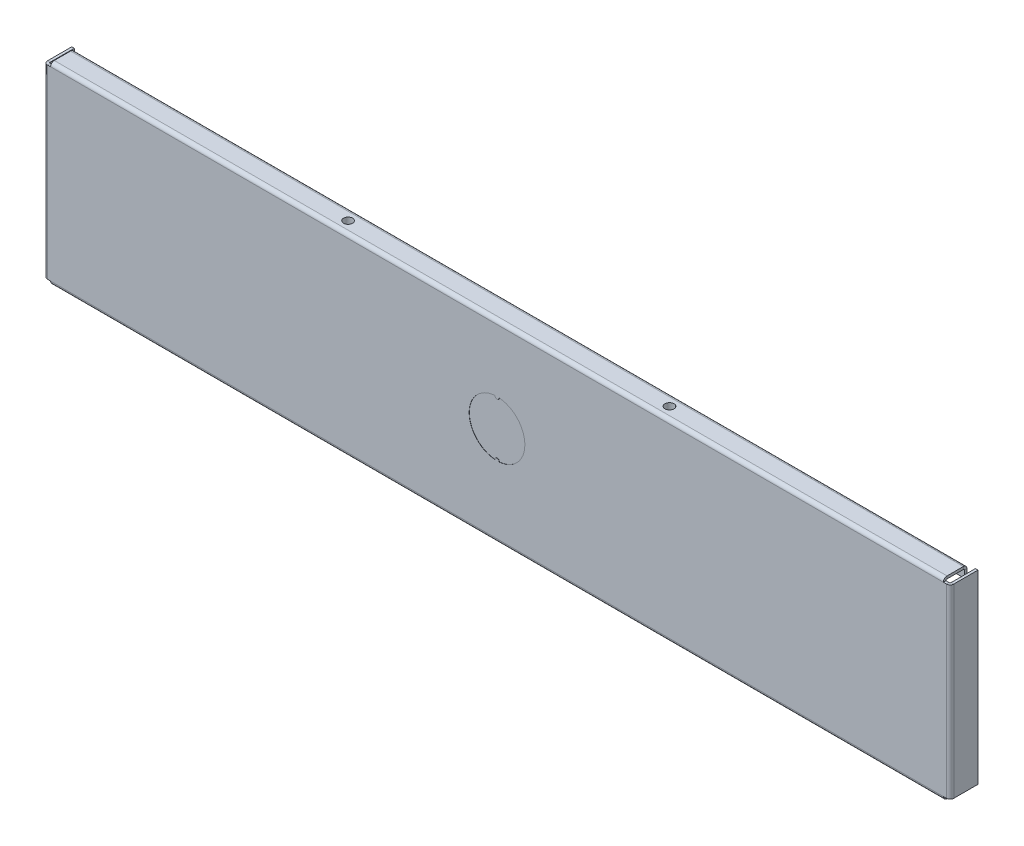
ISO-10303-21;
HEADER;
FILE_DESCRIPTION(('STEP AP214'),'2;1');
FILE_NAME('part.step','',(''),(''),'','','');
FILE_SCHEMA(('AUTOMOTIVE_DESIGN { 1 0 10303 214 1 1 1 1 }'));
ENDSEC;
DATA;
#1=APPLICATION_CONTEXT('core data for automotive mechanical design processes');
#2=APPLICATION_PROTOCOL_DEFINITION('international standard','automotive_design',2000,#1);
#3=PRODUCT_CONTEXT('',#1,'mechanical');
#4=PRODUCT('Part','Part','',(#3));
#5=PRODUCT_RELATED_PRODUCT_CATEGORY('part','',(#4));
#6=PRODUCT_DEFINITION_FORMATION('','',#4);
#7=PRODUCT_DEFINITION_CONTEXT('part definition',#1,'design');
#8=PRODUCT_DEFINITION('design','',#6,#7);
#9=PRODUCT_DEFINITION_SHAPE('','',#8);
#10=(LENGTH_UNIT() NAMED_UNIT(*) SI_UNIT(.MILLI.,.METRE.));
#11=(NAMED_UNIT(*) PLANE_ANGLE_UNIT() SI_UNIT($,.RADIAN.));
#12=(NAMED_UNIT(*) SI_UNIT($,.STERADIAN.) SOLID_ANGLE_UNIT());
#13=UNCERTAINTY_MEASURE_WITH_UNIT(LENGTH_MEASURE(1.E-05),#10,'distance_accuracy_value','');
#14=(GEOMETRIC_REPRESENTATION_CONTEXT(3) GLOBAL_UNCERTAINTY_ASSIGNED_CONTEXT((#13)) GLOBAL_UNIT_ASSIGNED_CONTEXT((#10,
#11,#12)) REPRESENTATION_CONTEXT('',''));
#15=CARTESIAN_POINT('',(0.,0.,0.));
#16=DIRECTION('',(0.,0.,1.));
#17=DIRECTION('',(1.,0.,0.));
#18=AXIS2_PLACEMENT_3D('',#15,#16,#17);
#19=CARTESIAN_POINT('',(0.,86.6,-1.2));
#20=DIRECTION('',(0.,0.,-1.));
#21=DIRECTION('',(-1.,0.,0.));
#22=AXIS2_PLACEMENT_3D('',#19,#20,#21);
#23=PLANE('',#22);
#24=DIRECTION('',(1.,0.,0.));
#25=VECTOR('',#24,1.);
#26=CARTESIAN_POINT('',(0.,0.,-1.2));
#27=LINE('',#26,#25);
#28=CARTESIAN_POINT('',(1.7,0.,-1.2));
#29=VERTEX_POINT('',#28);
#30=CARTESIAN_POINT('',(3.14999999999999,0.,-1.19999999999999));
#31=VERTEX_POINT('',#30);
#32=EDGE_CURVE('E637',#29,#31,#27,.T.);
#33=ORIENTED_EDGE('',*,*,#32,.F.);
#34=DIRECTION('',(0.,1.,0.));
#35=VECTOR('',#34,1.);
#36=CARTESIAN_POINT('',(1.7,86.6,-1.2));
#37=LINE('',#36,#35);
#38=CARTESIAN_POINT('',(1.7,86.6,-1.2));
#39=VERTEX_POINT('',#38);
#40=EDGE_CURVE('E502',#39,#29,#37,.F.);
#41=ORIENTED_EDGE('',*,*,#40,.F.);
#42=DIRECTION('',(-1.,0.,0.));
#43=VECTOR('',#42,1.);
#44=CARTESIAN_POINT('',(0.,86.6,-1.2));
#45=LINE('',#44,#43);
#46=CARTESIAN_POINT('',(3.14999999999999,86.6,-1.19999999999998));
#47=VERTEX_POINT('',#46);
#48=EDGE_CURVE('E154',#47,#39,#45,.T.);
#49=ORIENTED_EDGE('',*,*,#48,.F.);
#50=DIRECTION('',(1.,0.,0.));
#51=VECTOR('',#50,1.);
#52=CARTESIAN_POINT('',(419.75,86.6,-1.19999999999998));
#53=LINE('',#52,#51);
#54=CARTESIAN_POINT('',(419.75,86.6,-1.19999999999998));
#55=VERTEX_POINT('',#54);
#56=EDGE_CURVE('E720',#55,#47,#53,.F.);
#57=ORIENTED_EDGE('',*,*,#56,.F.);
#58=CARTESIAN_POINT('',(421.2,86.6,-1.2));
#59=VERTEX_POINT('',#58);
#60=EDGE_CURVE('E13',#59,#55,#45,.T.);
#61=ORIENTED_EDGE('',*,*,#60,.F.);
#62=DIRECTION('',(0.,-1.,0.));
#63=VECTOR('',#62,1.);
#64=CARTESIAN_POINT('',(421.2,0.,-1.19999999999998));
#65=LINE('',#64,#63);
#66=CARTESIAN_POINT('',(421.2,0.,-1.2));
#67=VERTEX_POINT('',#66);
#68=EDGE_CURVE('E555',#67,#59,#65,.F.);
#69=ORIENTED_EDGE('',*,*,#68,.F.);
#70=CARTESIAN_POINT('',(419.75,0.,-1.19999999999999));
#71=VERTEX_POINT('',#70);
#72=EDGE_CURVE('E624',#71,#67,#27,.T.);
#73=ORIENTED_EDGE('',*,*,#72,.F.);
#74=DIRECTION('',(-1.,0.,0.));
#75=VECTOR('',#74,1.);
#76=CARTESIAN_POINT('',(3.14999999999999,0.,-1.19999999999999));
#77=LINE('',#76,#75);
#78=EDGE_CURVE('E613',#31,#71,#77,.F.);
#79=ORIENTED_EDGE('',*,*,#78,.F.);
#80=EDGE_LOOP('',(#33,#41,#49,#57,#61,#69,#73,#79));
#81=FACE_BOUND('',#80,.T.);
#82=CARTESIAN_POINT('',(211.45,57.3921408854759,-1.2));
#83=DIRECTION('',(0.,0.,1.));
#84=DIRECTION('',(-1.,0.,0.));
#85=AXIS2_PLACEMENT_3D('',#82,#83,#84);
#86=CIRCLE('',#85,0.999999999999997);
#87=CARTESIAN_POINT('',(210.452419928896,57.4616678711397,-1.2));
#88=VERTEX_POINT('',#87);
#89=CARTESIAN_POINT('',(212.447580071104,57.4616678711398,-1.2));
#90=VERTEX_POINT('',#89);
#91=EDGE_CURVE('E1555',#88,#90,#86,.T.);
#92=ORIENTED_EDGE('',*,*,#91,.F.);
#93=CARTESIAN_POINT('',(211.45,44.5,-1.2));
#94=DIRECTION('',(0.,0.,-1.));
#95=DIRECTION('',(-1.,0.,0.));
#96=AXIS2_PLACEMENT_3D('',#93,#94,#95);
#97=CIRCLE('',#96,13.);
#98=CARTESIAN_POINT('',(210.452311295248,31.5383404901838,-1.2));
#99=VERTEX_POINT('',#98);
#100=EDGE_CURVE('E402',#99,#88,#97,.T.);
#101=ORIENTED_EDGE('',*,*,#100,.F.);
#102=CARTESIAN_POINT('',(211.45,31.6062908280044,-1.2));
#103=DIRECTION('',(0.,0.,1.));
#104=DIRECTION('',(-1.,0.,0.));
#105=AXIS2_PLACEMENT_3D('',#102,#103,#104);
#106=CIRCLE('',#105,1.00000000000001);
#107=CARTESIAN_POINT('',(212.447688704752,31.5383404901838,-1.2));
#108=VERTEX_POINT('',#107);
#109=EDGE_CURVE('E398',#108,#99,#106,.T.);
#110=ORIENTED_EDGE('',*,*,#109,.F.);
#111=CARTESIAN_POINT('',(211.45,44.5,-1.2));
#112=DIRECTION('',(0.,0.,-1.));
#113=DIRECTION('',(-1.,0.,0.));
#114=AXIS2_PLACEMENT_3D('',#111,#112,#113);
#115=CIRCLE('',#114,13.);
#116=EDGE_CURVE('E1552',#90,#108,#115,.T.);
#117=ORIENTED_EDGE('',*,*,#116,.F.);
#118=EDGE_LOOP('',(#92,#101,#110,#117));
#119=FACE_BOUND('',#118,.T.);
#120=ADVANCED_FACE('F145',(#81,#119),#23,.T.);
#121=CARTESIAN_POINT('',(0.,86.6,0.));
#122=DIRECTION('',(0.,0.,-1.));
#123=DIRECTION('',(-1.,0.,0.));
#124=AXIS2_PLACEMENT_3D('',#121,#122,#123);
#125=PLANE('',#124);
#126=CARTESIAN_POINT('',(211.45,57.3921408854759,0.));
#127=DIRECTION('',(0.,0.,-1.));
#128=DIRECTION('',(1.,0.,0.));
#129=AXIS2_PLACEMENT_3D('',#126,#127,#128);
#130=CIRCLE('',#129,1.00000000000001);
#131=CARTESIAN_POINT('',(212.447580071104,57.4616678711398,0.));
#132=VERTEX_POINT('',#131);
#133=CARTESIAN_POINT('',(210.452419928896,57.4616678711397,0.));
#134=VERTEX_POINT('',#133);
#135=EDGE_CURVE('E442',#132,#134,#130,.T.);
#136=ORIENTED_EDGE('',*,*,#135,.F.);
#137=CARTESIAN_POINT('',(211.45,44.5,0.));
#138=DIRECTION('',(0.,0.,1.));
#139=DIRECTION('',(1.,0.,0.));
#140=AXIS2_PLACEMENT_3D('',#137,#138,#139);
#141=CIRCLE('',#140,13.);
#142=CARTESIAN_POINT('',(212.447688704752,31.5383404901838,0.));
#143=VERTEX_POINT('',#142);
#144=EDGE_CURVE('E170',#143,#132,#141,.T.);
#145=ORIENTED_EDGE('',*,*,#144,.F.);
#146=CARTESIAN_POINT('',(211.45,31.6062908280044,0.));
#147=DIRECTION('',(0.,0.,-1.));
#148=DIRECTION('',(1.,0.,0.));
#149=AXIS2_PLACEMENT_3D('',#146,#147,#148);
#150=CIRCLE('',#149,1.00000000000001);
#151=CARTESIAN_POINT('',(210.452311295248,31.5383404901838,0.));
#152=VERTEX_POINT('',#151);
#153=EDGE_CURVE('E431',#152,#143,#150,.T.);
#154=ORIENTED_EDGE('',*,*,#153,.F.);
#155=CARTESIAN_POINT('',(211.45,44.5,0.));
#156=DIRECTION('',(0.,0.,1.));
#157=DIRECTION('',(1.,0.,0.));
#158=AXIS2_PLACEMENT_3D('',#155,#156,#157);
#159=CIRCLE('',#158,13.);
#160=EDGE_CURVE('E445',#134,#152,#159,.T.);
#161=ORIENTED_EDGE('',*,*,#160,.F.);
#162=EDGE_LOOP('',(#136,#145,#154,#161));
#163=FACE_BOUND('',#162,.T.);
#164=DIRECTION('',(0.,1.,0.));
#165=VECTOR('',#164,1.);
#166=CARTESIAN_POINT('',(1.7,86.6,0.));
#167=LINE('',#166,#165);
#168=CARTESIAN_POINT('',(1.7,86.6,0.));
#169=VERTEX_POINT('',#168);
#170=CARTESIAN_POINT('',(1.7,0.,0.));
#171=VERTEX_POINT('',#170);
#172=EDGE_CURVE('E490',#169,#171,#167,.F.);
#173=ORIENTED_EDGE('',*,*,#172,.T.);
#174=DIRECTION('',(1.,0.,0.));
#175=VECTOR('',#174,1.);
#176=CARTESIAN_POINT('',(0.,0.,0.));
#177=LINE('',#176,#175);
#178=CARTESIAN_POINT('',(3.14999999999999,0.,0.));
#179=VERTEX_POINT('',#178);
#180=EDGE_CURVE('E634',#171,#179,#177,.T.);
#181=ORIENTED_EDGE('',*,*,#180,.T.);
#182=DIRECTION('',(-1.,0.,0.));
#183=VECTOR('',#182,1.);
#184=CARTESIAN_POINT('',(3.14999999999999,0.,0.));
#185=LINE('',#184,#183);
#186=CARTESIAN_POINT('',(419.75,0.,0.));
#187=VERTEX_POINT('',#186);
#188=EDGE_CURVE('E619',#179,#187,#185,.F.);
#189=ORIENTED_EDGE('',*,*,#188,.T.);
#190=CARTESIAN_POINT('',(421.2,0.,0.));
#191=VERTEX_POINT('',#190);
#192=EDGE_CURVE('E652',#187,#191,#177,.T.);
#193=ORIENTED_EDGE('',*,*,#192,.T.);
#194=DIRECTION('',(0.,-1.,0.));
#195=VECTOR('',#194,1.);
#196=CARTESIAN_POINT('',(421.2,0.,0.));
#197=LINE('',#196,#195);
#198=CARTESIAN_POINT('',(421.2,86.6,0.));
#199=VERTEX_POINT('',#198);
#200=EDGE_CURVE('E543',#191,#199,#197,.F.);
#201=ORIENTED_EDGE('',*,*,#200,.T.);
#202=DIRECTION('',(-1.,0.,0.));
#203=VECTOR('',#202,1.);
#204=CARTESIAN_POINT('',(0.,86.6,0.));
#205=LINE('',#204,#203);
#206=CARTESIAN_POINT('',(419.75,86.6,0.));
#207=VERTEX_POINT('',#206);
#208=EDGE_CURVE('E622',#199,#207,#205,.T.);
#209=ORIENTED_EDGE('',*,*,#208,.T.);
#210=DIRECTION('',(1.,0.,0.));
#211=VECTOR('',#210,1.);
#212=CARTESIAN_POINT('',(419.75,86.6,0.));
#213=LINE('',#212,#211);
#214=CARTESIAN_POINT('',(3.14999999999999,86.6,0.));
#215=VERTEX_POINT('',#214);
#216=EDGE_CURVE('E951',#207,#215,#213,.F.);
#217=ORIENTED_EDGE('',*,*,#216,.T.);
#218=EDGE_CURVE('E625',#215,#169,#205,.T.);
#219=ORIENTED_EDGE('',*,*,#218,.T.);
#220=EDGE_LOOP('',(#173,#181,#189,#193,#201,#209,#217,#219));
#221=FACE_BOUND('',#220,.T.);
#222=ADVANCED_FACE('F676',(#163,#221),#125,.F.);
#223=CARTESIAN_POINT('',(0.,86.6,-1.2));
#224=DIRECTION('',(0.,1.,0.));
#225=DIRECTION('',(0.,0.,1.));
#226=AXIS2_PLACEMENT_3D('',#223,#224,#225);
#227=PLANE('',#226);
#228=ORIENTED_EDGE('',*,*,#48,.T.);
#229=DIRECTION('',(0.,0.,1.));
#230=VECTOR('',#229,1.);
#231=CARTESIAN_POINT('',(1.7,86.6,-1.2));
#232=LINE('',#231,#230);
#233=EDGE_CURVE('E496',#39,#169,#232,.T.);
#234=ORIENTED_EDGE('',*,*,#233,.T.);
#235=ORIENTED_EDGE('',*,*,#218,.F.);
#236=DIRECTION('',(0.,0.,1.));
#237=VECTOR('',#236,1.);
#238=CARTESIAN_POINT('',(3.14999999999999,86.6,-1.19999999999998));
#239=LINE('',#238,#237);
#240=EDGE_CURVE('E870',#47,#215,#239,.T.);
#241=ORIENTED_EDGE('',*,*,#240,.F.);
#242=EDGE_LOOP('',(#228,#234,#235,#241));
#243=FACE_BOUND('',#242,.T.);
#244=ADVANCED_FACE('F682',(#243),#227,.T.);
#245=CARTESIAN_POINT('',(0.,0.,-1.2));
#246=DIRECTION('',(0.,-1.,0.));
#247=DIRECTION('',(0.,0.,-1.));
#248=AXIS2_PLACEMENT_3D('',#245,#246,#247);
#249=PLANE('',#248);
#250=ORIENTED_EDGE('',*,*,#72,.T.);
#251=DIRECTION('',(0.,0.,1.));
#252=VECTOR('',#251,1.);
#253=CARTESIAN_POINT('',(421.2,0.,-1.19999999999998));
#254=LINE('',#253,#252);
#255=EDGE_CURVE('E549',#67,#191,#254,.T.);
#256=ORIENTED_EDGE('',*,*,#255,.T.);
#257=ORIENTED_EDGE('',*,*,#192,.F.);
#258=DIRECTION('',(0.,0.,1.));
#259=VECTOR('',#258,1.);
#260=CARTESIAN_POINT('',(419.75,0.,-1.19999999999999));
#261=LINE('',#260,#259);
#262=EDGE_CURVE('E602',#71,#187,#261,.T.);
#263=ORIENTED_EDGE('',*,*,#262,.F.);
#264=EDGE_LOOP('',(#250,#256,#257,#263));
#265=FACE_BOUND('',#264,.T.);
#266=ADVANCED_FACE('F147',(#265),#249,.T.);
#267=DIRECTION('',(0.,0.,1.));
#268=VECTOR('',#267,1.);
#269=CARTESIAN_POINT('',(1.7,0.,-1.2));
#270=LINE('',#269,#268);
#271=EDGE_CURVE('E507',#29,#171,#270,.T.);
#272=ORIENTED_EDGE('',*,*,#271,.F.);
#273=ORIENTED_EDGE('',*,*,#32,.T.);
#274=DIRECTION('',(0.,0.,1.));
#275=VECTOR('',#274,1.);
#276=CARTESIAN_POINT('',(3.14999999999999,0.,-1.19999999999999));
#277=LINE('',#276,#275);
#278=EDGE_CURVE('E606',#31,#179,#277,.T.);
#279=ORIENTED_EDGE('',*,*,#278,.T.);
#280=ORIENTED_EDGE('',*,*,#180,.F.);
#281=EDGE_LOOP('',(#272,#273,#279,#280));
#282=FACE_BOUND('',#281,.T.);
#283=ADVANCED_FACE('F696',(#282),#249,.T.);
#284=CARTESIAN_POINT('',(419.75,88.3,-1.19999999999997));
#285=DIRECTION('',(1.,0.,0.));
#286=DIRECTION('',(0.,0.,-1.));
#287=AXIS2_PLACEMENT_3D('',#284,#285,#286);
#288=PLANE('',#287);
#289=DIRECTION('',(0.,0.,-1.));
#290=VECTOR('',#289,1.);
#291=CARTESIAN_POINT('',(419.75,87.1,-1.19999999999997));
#292=LINE('',#291,#290);
#293=CARTESIAN_POINT('',(419.75,87.1,-9.30000000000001));
#294=VERTEX_POINT('',#293);
#295=CARTESIAN_POINT('',(419.75,87.1,-1.69999999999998));
#296=VERTEX_POINT('',#295);
#297=EDGE_CURVE('E970',#294,#296,#292,.F.);
#298=ORIENTED_EDGE('',*,*,#297,.F.);
#299=DIRECTION('',(0.,1.,0.));
#300=VECTOR('',#299,1.);
#301=CARTESIAN_POINT('',(419.75,87.1,-9.30000000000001));
#302=LINE('',#301,#300);
#303=CARTESIAN_POINT('',(419.75,88.3,-9.3));
#304=VERTEX_POINT('',#303);
#305=EDGE_CURVE('E977',#294,#304,#302,.T.);
#306=ORIENTED_EDGE('',*,*,#305,.T.);
#307=DIRECTION('',(0.,0.,1.));
#308=VECTOR('',#307,1.);
#309=CARTESIAN_POINT('',(419.75,88.3,-1.19999999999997));
#310=LINE('',#309,#308);
#311=CARTESIAN_POINT('',(419.75,88.3,-1.69999999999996));
#312=VERTEX_POINT('',#311);
#313=EDGE_CURVE('E975',#304,#312,#310,.T.);
#314=ORIENTED_EDGE('',*,*,#313,.T.);
#315=DIRECTION('',(0.,1.,0.));
#316=VECTOR('',#315,1.);
#317=CARTESIAN_POINT('',(419.75,87.1,-1.69999999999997));
#318=LINE('',#317,#316);
#319=EDGE_CURVE('E961',#296,#312,#318,.T.);
#320=ORIENTED_EDGE('',*,*,#319,.F.);
#321=EDGE_LOOP('',(#298,#306,#314,#320));
#322=FACE_BOUND('',#321,.T.);
#323=ADVANCED_FACE('F841',(#322),#288,.T.);
#324=CARTESIAN_POINT('',(419.75,88.3,-1.19999999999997));
#325=DIRECTION('',(0.,1.,0.));
#326=DIRECTION('',(0.,0.,1.));
#327=AXIS2_PLACEMENT_3D('',#324,#325,#326);
#328=PLANE('',#327);
#329=CARTESIAN_POINT('',(136.45,88.3000000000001,-5.5));
#330=DIRECTION('',(0.,1.,0.));
#331=DIRECTION('',(0.,0.,1.));
#332=AXIS2_PLACEMENT_3D('',#329,#330,#331);
#333=CIRCLE('',#332,2.09999999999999);
#334=CARTESIAN_POINT('',(136.45,88.3000000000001,-3.40000000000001));
#335=VERTEX_POINT('',#334);
#336=EDGE_CURVE('E404',#335,#335,#333,.T.);
#337=ORIENTED_EDGE('',*,*,#336,.F.);
#338=EDGE_LOOP('',(#337));
#339=FACE_BOUND('',#338,.T.);
#340=CARTESIAN_POINT('',(286.45,88.3000000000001,-5.5));
#341=DIRECTION('',(0.,1.,0.));
#342=DIRECTION('',(0.,0.,1.));
#343=AXIS2_PLACEMENT_3D('',#340,#341,#342);
#344=CIRCLE('',#343,2.09999999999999);
#345=CARTESIAN_POINT('',(286.45,88.3000000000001,-3.40000000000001));
#346=VERTEX_POINT('',#345);
#347=EDGE_CURVE('E414',#346,#346,#344,.T.);
#348=ORIENTED_EDGE('',*,*,#347,.F.);
#349=EDGE_LOOP('',(#348));
#350=FACE_BOUND('',#349,.T.);
#351=ORIENTED_EDGE('',*,*,#313,.F.);
#352=DIRECTION('',(1.,0.,0.));
#353=VECTOR('',#352,1.);
#354=CARTESIAN_POINT('',(419.75,88.3,-9.3));
#355=LINE('',#354,#353);
#356=CARTESIAN_POINT('',(3.14999999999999,88.3,-9.3));
#357=VERTEX_POINT('',#356);
#358=EDGE_CURVE('E995',#304,#357,#355,.F.);
#359=ORIENTED_EDGE('',*,*,#358,.T.);
#360=DIRECTION('',(0.,0.,-1.));
#361=VECTOR('',#360,1.);
#362=CARTESIAN_POINT('',(3.14999999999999,88.3,-11.));
#363=LINE('',#362,#361);
#364=CARTESIAN_POINT('',(3.14999999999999,88.3,-1.69999999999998));
#365=VERTEX_POINT('',#364);
#366=EDGE_CURVE('E972',#365,#357,#363,.T.);
#367=ORIENTED_EDGE('',*,*,#366,.F.);
#368=DIRECTION('',(1.,0.,0.));
#369=VECTOR('',#368,1.);
#370=CARTESIAN_POINT('',(419.75,88.3,-1.69999999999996));
#371=LINE('',#370,#369);
#372=EDGE_CURVE('E964',#365,#312,#371,.T.);
#373=ORIENTED_EDGE('',*,*,#372,.T.);
#374=EDGE_LOOP('',(#351,#359,#367,#373));
#375=FACE_BOUND('',#374,.T.);
#376=ADVANCED_FACE('F706',(#339,#350,#375),#328,.T.);
#377=CARTESIAN_POINT('',(419.75,87.1,-1.19999999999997));
#378=DIRECTION('',(0.,1.,0.));
#379=DIRECTION('',(0.,0.,1.));
#380=AXIS2_PLACEMENT_3D('',#377,#378,#379);
#381=PLANE('',#380);
#382=CARTESIAN_POINT('',(136.45,87.1,-5.50000000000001));
#383=DIRECTION('',(0.,1.,0.));
#384=DIRECTION('',(0.,0.,1.));
#385=AXIS2_PLACEMENT_3D('',#382,#383,#384);
#386=CIRCLE('',#385,3.4);
#387=CARTESIAN_POINT('',(136.45,87.1,-2.10000000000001));
#388=VERTEX_POINT('',#387);
#389=EDGE_CURVE('E149',#388,#388,#386,.T.);
#390=ORIENTED_EDGE('',*,*,#389,.T.);
#391=EDGE_LOOP('',(#390));
#392=FACE_BOUND('',#391,.T.);
#393=CARTESIAN_POINT('',(286.45,87.1,-5.50000000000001));
#394=DIRECTION('',(0.,1.,0.));
#395=DIRECTION('',(0.,0.,1.));
#396=AXIS2_PLACEMENT_3D('',#393,#394,#395);
#397=CIRCLE('',#396,3.39999999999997);
#398=CARTESIAN_POINT('',(286.45,87.1,-2.10000000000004));
#399=VERTEX_POINT('',#398);
#400=EDGE_CURVE('E426',#399,#399,#397,.T.);
#401=ORIENTED_EDGE('',*,*,#400,.T.);
#402=EDGE_LOOP('',(#401));
#403=FACE_BOUND('',#402,.T.);
#404=DIRECTION('',(1.,0.,0.));
#405=VECTOR('',#404,1.);
#406=CARTESIAN_POINT('',(419.75,87.1,-9.30000000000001));
#407=LINE('',#406,#405);
#408=CARTESIAN_POINT('',(3.14999999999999,87.1,-9.30000000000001));
#409=VERTEX_POINT('',#408);
#410=EDGE_CURVE('E986',#294,#409,#407,.F.);
#411=ORIENTED_EDGE('',*,*,#410,.F.);
#412=ORIENTED_EDGE('',*,*,#297,.T.);
#413=DIRECTION('',(-1.,0.,0.));
#414=VECTOR('',#413,1.);
#415=CARTESIAN_POINT('',(3.14999999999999,87.1,-1.69999999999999));
#416=LINE('',#415,#414);
#417=CARTESIAN_POINT('',(3.14999999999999,87.1,-1.69999999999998));
#418=VERTEX_POINT('',#417);
#419=EDGE_CURVE('E958',#418,#296,#416,.F.);
#420=ORIENTED_EDGE('',*,*,#419,.F.);
#421=DIRECTION('',(0.,0.,1.));
#422=VECTOR('',#421,1.);
#423=CARTESIAN_POINT('',(3.14999999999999,87.1,-1.19999999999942));
#424=LINE('',#423,#422);
#425=EDGE_CURVE('E967',#418,#409,#424,.F.);
#426=ORIENTED_EDGE('',*,*,#425,.T.);
#427=EDGE_LOOP('',(#411,#412,#420,#426));
#428=FACE_BOUND('',#427,.T.);
#429=ADVANCED_FACE('F656',(#392,#403,#428),#381,.F.);
#430=DIRECTION('',(0.,0.,1.));
#431=VECTOR('',#430,1.);
#432=CARTESIAN_POINT('',(421.2,86.6,-1.19999999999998));
#433=LINE('',#432,#431);
#434=EDGE_CURVE('E560',#59,#199,#433,.T.);
#435=ORIENTED_EDGE('',*,*,#434,.F.);
#436=ORIENTED_EDGE('',*,*,#60,.T.);
#437=DIRECTION('',(0.,0.,1.));
#438=VECTOR('',#437,1.);
#439=CARTESIAN_POINT('',(419.75,86.6,-1.19999999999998));
#440=LINE('',#439,#438);
#441=EDGE_CURVE('E878',#55,#207,#440,.T.);
#442=ORIENTED_EDGE('',*,*,#441,.T.);
#443=ORIENTED_EDGE('',*,*,#208,.F.);
#444=EDGE_LOOP('',(#435,#436,#442,#443));
#445=FACE_BOUND('',#444,.T.);
#446=ADVANCED_FACE('F692',(#445),#227,.T.);
#447=CARTESIAN_POINT('',(3.14999999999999,86.6,-1.69999999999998));
#448=DIRECTION('',(-1.,0.,0.));
#449=DIRECTION('',(0.,0.,1.));
#450=AXIS2_PLACEMENT_3D('',#447,#448,#449);
#451=PLANE('',#450);
#452=DIRECTION('',(0.,1.,0.));
#453=VECTOR('',#452,1.);
#454=CARTESIAN_POINT('',(3.15,88.3,-1.69999999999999));
#455=LINE('',#454,#453);
#456=EDGE_CURVE('E873',#418,#365,#455,.T.);
#457=ORIENTED_EDGE('',*,*,#456,.F.);
#458=CARTESIAN_POINT('',(3.14999999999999,86.6,-1.69999999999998));
#459=DIRECTION('',(1.,0.,0.));
#460=DIRECTION('',(0.,0.,-1.));
#461=AXIS2_PLACEMENT_3D('',#458,#459,#460);
#462=CIRCLE('',#461,0.5);
#463=EDGE_CURVE('E863',#47,#418,#462,.F.);
#464=ORIENTED_EDGE('',*,*,#463,.F.);
#465=ORIENTED_EDGE('',*,*,#240,.T.);
#466=CARTESIAN_POINT('',(3.14999999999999,86.6,-1.69999999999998));
#467=DIRECTION('',(1.,0.,0.));
#468=DIRECTION('',(0.,0.,-1.));
#469=AXIS2_PLACEMENT_3D('',#466,#467,#468);
#470=CIRCLE('',#469,1.7);
#471=EDGE_CURVE('E949',#215,#365,#470,.F.);
#472=ORIENTED_EDGE('',*,*,#471,.T.);
#473=EDGE_LOOP('',(#457,#464,#465,#472));
#474=FACE_BOUND('',#473,.T.);
#475=ADVANCED_FACE('F699',(#474),#451,.T.);
#476=CARTESIAN_POINT('',(419.75,86.6,-1.69999999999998));
#477=DIRECTION('',(-1.,0.,0.));
#478=DIRECTION('',(0.,0.,1.));
#479=AXIS2_PLACEMENT_3D('',#476,#477,#478);
#480=PLANE('',#479);
#481=CARTESIAN_POINT('',(419.75,86.6,-1.69999999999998));
#482=DIRECTION('',(1.,0.,0.));
#483=DIRECTION('',(0.,0.,-1.));
#484=AXIS2_PLACEMENT_3D('',#481,#482,#483);
#485=CIRCLE('',#484,0.5);
#486=EDGE_CURVE('E866',#296,#55,#485,.T.);
#487=ORIENTED_EDGE('',*,*,#486,.F.);
#488=ORIENTED_EDGE('',*,*,#319,.T.);
#489=CARTESIAN_POINT('',(419.75,86.6,-1.69999999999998));
#490=DIRECTION('',(1.,0.,0.));
#491=DIRECTION('',(0.,0.,-1.));
#492=AXIS2_PLACEMENT_3D('',#489,#490,#491);
#493=CIRCLE('',#492,1.7);
#494=EDGE_CURVE('E638',#312,#207,#493,.T.);
#495=ORIENTED_EDGE('',*,*,#494,.T.);
#496=ORIENTED_EDGE('',*,*,#441,.F.);
#497=EDGE_LOOP('',(#487,#488,#495,#496));
#498=FACE_BOUND('',#497,.T.);
#499=ADVANCED_FACE('F688',(#498),#480,.F.);
#500=CARTESIAN_POINT('',(419.75,86.6,-1.69999999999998));
#501=DIRECTION('',(1.,0.,0.));
#502=DIRECTION('',(0.,1.,0.));
#503=AXIS2_PLACEMENT_3D('',#500,#501,#502);
#504=CYLINDRICAL_SURFACE('',#503,1.7);
#505=ORIENTED_EDGE('',*,*,#216,.F.);
#506=ORIENTED_EDGE('',*,*,#494,.F.);
#507=ORIENTED_EDGE('',*,*,#372,.F.);
#508=ORIENTED_EDGE('',*,*,#471,.F.);
#509=EDGE_LOOP('',(#505,#506,#507,#508));
#510=FACE_BOUND('',#509,.T.);
#511=ADVANCED_FACE('F851',(#510),#504,.T.);
#512=CARTESIAN_POINT('',(419.75,86.6,-1.69999999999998));
#513=DIRECTION('',(1.,0.,0.));
#514=DIRECTION('',(0.,1.,0.));
#515=AXIS2_PLACEMENT_3D('',#512,#513,#514);
#516=CYLINDRICAL_SURFACE('',#515,0.5);
#517=ORIENTED_EDGE('',*,*,#56,.T.);
#518=ORIENTED_EDGE('',*,*,#463,.T.);
#519=ORIENTED_EDGE('',*,*,#419,.T.);
#520=ORIENTED_EDGE('',*,*,#486,.T.);
#521=EDGE_LOOP('',(#517,#518,#519,#520));
#522=FACE_BOUND('',#521,.T.);
#523=ADVANCED_FACE('F849',(#522),#516,.F.);
#524=CARTESIAN_POINT('',(3.14999999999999,88.3,-11.));
#525=DIRECTION('',(-1.,0.,0.));
#526=DIRECTION('',(0.,0.,1.));
#527=AXIS2_PLACEMENT_3D('',#524,#525,#526);
#528=PLANE('',#527);
#529=DIRECTION('',(0.,1.,0.));
#530=VECTOR('',#529,1.);
#531=CARTESIAN_POINT('',(3.14999999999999,87.1,-9.30000000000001));
#532=LINE('',#531,#530);
#533=EDGE_CURVE('E959',#409,#357,#532,.T.);
#534=ORIENTED_EDGE('',*,*,#533,.F.);
#535=ORIENTED_EDGE('',*,*,#425,.F.);
#536=ORIENTED_EDGE('',*,*,#456,.T.);
#537=ORIENTED_EDGE('',*,*,#366,.T.);
#538=EDGE_LOOP('',(#534,#535,#536,#537));
#539=FACE_BOUND('',#538,.T.);
#540=ADVANCED_FACE('F835',(#539),#528,.T.);
#541=CARTESIAN_POINT('',(3.14999999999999,86.6,-9.30000000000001));
#542=DIRECTION('',(-1.,0.,0.));
#543=DIRECTION('',(0.,0.,1.));
#544=AXIS2_PLACEMENT_3D('',#541,#542,#543);
#545=PLANE('',#544);
#546=DIRECTION('',(0.,0.,1.));
#547=VECTOR('',#546,1.);
#548=CARTESIAN_POINT('',(3.14999999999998,86.6,-11.));
#549=LINE('',#548,#547);
#550=CARTESIAN_POINT('',(3.14999999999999,86.6,-9.80000000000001));
#551=VERTEX_POINT('',#550);
#552=CARTESIAN_POINT('',(3.14999999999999,86.6,-11.));
#553=VERTEX_POINT('',#552);
#554=EDGE_CURVE('E605',#551,#553,#549,.F.);
#555=ORIENTED_EDGE('',*,*,#554,.F.);
#556=CARTESIAN_POINT('',(3.14999999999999,86.6,-9.30000000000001));
#557=DIRECTION('',(1.,0.,0.));
#558=DIRECTION('',(0.,0.,-1.));
#559=AXIS2_PLACEMENT_3D('',#556,#557,#558);
#560=CIRCLE('',#559,0.499999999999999);
#561=EDGE_CURVE('E989',#409,#551,#560,.F.);
#562=ORIENTED_EDGE('',*,*,#561,.F.);
#563=ORIENTED_EDGE('',*,*,#533,.T.);
#564=CARTESIAN_POINT('',(3.14999999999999,86.6,-9.30000000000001));
#565=DIRECTION('',(1.,0.,0.));
#566=DIRECTION('',(0.,0.,-1.));
#567=AXIS2_PLACEMENT_3D('',#564,#565,#566);
#568=CIRCLE('',#567,1.7);
#569=EDGE_CURVE('E980',#357,#553,#568,.F.);
#570=ORIENTED_EDGE('',*,*,#569,.T.);
#571=EDGE_LOOP('',(#555,#562,#563,#570));
#572=FACE_BOUND('',#571,.T.);
#573=ADVANCED_FACE('F832',(#572),#545,.T.);
#574=CARTESIAN_POINT('',(419.75,86.6,-9.30000000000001));
#575=DIRECTION('',(-1.,0.,0.));
#576=DIRECTION('',(0.,0.,1.));
#577=AXIS2_PLACEMENT_3D('',#574,#575,#576);
#578=PLANE('',#577);
#579=CARTESIAN_POINT('',(419.75,86.6,-9.30000000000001));
#580=DIRECTION('',(1.,0.,0.));
#581=DIRECTION('',(0.,0.,-1.));
#582=AXIS2_PLACEMENT_3D('',#579,#580,#581);
#583=CIRCLE('',#582,0.499999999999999);
#584=CARTESIAN_POINT('',(419.75,86.6,-9.80000000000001));
#585=VERTEX_POINT('',#584);
#586=EDGE_CURVE('E983',#585,#294,#583,.T.);
#587=ORIENTED_EDGE('',*,*,#586,.F.);
#588=DIRECTION('',(0.,0.,1.));
#589=VECTOR('',#588,1.);
#590=CARTESIAN_POINT('',(419.75,86.6,-9.80000000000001));
#591=LINE('',#590,#589);
#592=CARTESIAN_POINT('',(419.75,86.6,-11.));
#593=VERTEX_POINT('',#592);
#594=EDGE_CURVE('E1004',#585,#593,#591,.F.);
#595=ORIENTED_EDGE('',*,*,#594,.T.);
#596=CARTESIAN_POINT('',(419.75,86.6,-9.30000000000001));
#597=DIRECTION('',(1.,0.,0.));
#598=DIRECTION('',(0.,0.,-1.));
#599=AXIS2_PLACEMENT_3D('',#596,#597,#598);
#600=CIRCLE('',#599,1.7);
#601=EDGE_CURVE('E992',#593,#304,#600,.T.);
#602=ORIENTED_EDGE('',*,*,#601,.T.);
#603=ORIENTED_EDGE('',*,*,#305,.F.);
#604=EDGE_LOOP('',(#587,#595,#602,#603));
#605=FACE_BOUND('',#604,.T.);
#606=ADVANCED_FACE('F827',(#605),#578,.F.);
#607=CARTESIAN_POINT('',(419.75,86.6,-9.30000000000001));
#608=DIRECTION('',(1.,0.,0.));
#609=DIRECTION('',(0.,0.,-1.));
#610=AXIS2_PLACEMENT_3D('',#607,#608,#609);
#611=CYLINDRICAL_SURFACE('',#610,1.7);
#612=ORIENTED_EDGE('',*,*,#358,.F.);
#613=ORIENTED_EDGE('',*,*,#601,.F.);
#614=DIRECTION('',(1.,0.,0.));
#615=VECTOR('',#614,1.);
#616=CARTESIAN_POINT('',(3.14999999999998,86.6,-11.));
#617=LINE('',#616,#615);
#618=EDGE_CURVE('E1007',#553,#593,#617,.T.);
#619=ORIENTED_EDGE('',*,*,#618,.F.);
#620=ORIENTED_EDGE('',*,*,#569,.F.);
#621=EDGE_LOOP('',(#612,#613,#619,#620));
#622=FACE_BOUND('',#621,.T.);
#623=ADVANCED_FACE('F824',(#622),#611,.T.);
#624=CARTESIAN_POINT('',(419.75,86.6,-9.30000000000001));
#625=DIRECTION('',(1.,0.,0.));
#626=DIRECTION('',(0.,0.,-1.));
#627=AXIS2_PLACEMENT_3D('',#624,#625,#626);
#628=CYLINDRICAL_SURFACE('',#627,0.499999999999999);
#629=ORIENTED_EDGE('',*,*,#410,.T.);
#630=ORIENTED_EDGE('',*,*,#561,.T.);
#631=DIRECTION('',(-1.,0.,0.));
#632=VECTOR('',#631,1.);
#633=CARTESIAN_POINT('',(3.14999999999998,86.6,-9.80000000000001));
#634=LINE('',#633,#632);
#635=EDGE_CURVE('E1002',#551,#585,#634,.F.);
#636=ORIENTED_EDGE('',*,*,#635,.T.);
#637=ORIENTED_EDGE('',*,*,#586,.T.);
#638=EDGE_LOOP('',(#629,#630,#636,#637));
#639=FACE_BOUND('',#638,.T.);
#640=ADVANCED_FACE('F822',(#639),#628,.F.);
#641=CARTESIAN_POINT('',(3.14999999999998,83.3000000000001,-11.));
#642=DIRECTION('',(1.,0.,0.));
#643=DIRECTION('',(0.,1.,0.));
#644=AXIS2_PLACEMENT_3D('',#641,#642,#643);
#645=PLANE('',#644);
#646=ORIENTED_EDGE('',*,*,#554,.T.);
#647=DIRECTION('',(0.,-1.,0.));
#648=VECTOR('',#647,1.);
#649=CARTESIAN_POINT('',(3.14999999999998,87.1,-11.));
#650=LINE('',#649,#648);
#651=CARTESIAN_POINT('',(3.14999999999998,83.3000000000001,-11.));
#652=VERTEX_POINT('',#651);
#653=EDGE_CURVE('E1017',#652,#553,#650,.F.);
#654=ORIENTED_EDGE('',*,*,#653,.F.);
#655=DIRECTION('',(0.,0.,1.));
#656=VECTOR('',#655,1.);
#657=CARTESIAN_POINT('',(3.14999999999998,83.3000000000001,-11.));
#658=LINE('',#657,#656);
#659=CARTESIAN_POINT('',(3.14999999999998,83.3000000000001,-9.80000000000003));
#660=VERTEX_POINT('',#659);
#661=EDGE_CURVE('E1024',#652,#660,#658,.T.);
#662=ORIENTED_EDGE('',*,*,#661,.T.);
#663=DIRECTION('',(0.,1.,0.));
#664=VECTOR('',#663,1.);
#665=CARTESIAN_POINT('',(3.14999999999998,83.3000000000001,-9.80000000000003));
#666=LINE('',#665,#664);
#667=EDGE_CURVE('E1010',#660,#551,#666,.T.);
#668=ORIENTED_EDGE('',*,*,#667,.T.);
#669=EDGE_LOOP('',(#646,#654,#662,#668));
#670=FACE_BOUND('',#669,.T.);
#671=ADVANCED_FACE('F818',(#670),#645,.F.);
#672=CARTESIAN_POINT('',(419.75,87.1,-11.));
#673=DIRECTION('',(-1.,0.,0.));
#674=DIRECTION('',(0.,0.,1.));
#675=AXIS2_PLACEMENT_3D('',#672,#673,#674);
#676=PLANE('',#675);
#677=ORIENTED_EDGE('',*,*,#594,.F.);
#678=DIRECTION('',(0.,-1.,0.));
#679=VECTOR('',#678,1.);
#680=CARTESIAN_POINT('',(419.75,87.1,-9.8));
#681=LINE('',#680,#679);
#682=CARTESIAN_POINT('',(419.75,83.3,-9.80000000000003));
#683=VERTEX_POINT('',#682);
#684=EDGE_CURVE('E1013',#585,#683,#681,.T.);
#685=ORIENTED_EDGE('',*,*,#684,.T.);
#686=DIRECTION('',(0.,0.,1.));
#687=VECTOR('',#686,1.);
#688=CARTESIAN_POINT('',(419.75,83.3,-11.));
#689=LINE('',#688,#687);
#690=CARTESIAN_POINT('',(419.75,83.3,-11.));
#691=VERTEX_POINT('',#690);
#692=EDGE_CURVE('E987',#691,#683,#689,.T.);
#693=ORIENTED_EDGE('',*,*,#692,.F.);
#694=DIRECTION('',(0.,1.,0.));
#695=VECTOR('',#694,1.);
#696=CARTESIAN_POINT('',(419.75,87.1,-11.));
#697=LINE('',#696,#695);
#698=EDGE_CURVE('E1020',#593,#691,#697,.F.);
#699=ORIENTED_EDGE('',*,*,#698,.F.);
#700=EDGE_LOOP('',(#677,#685,#693,#699));
#701=FACE_BOUND('',#700,.T.);
#702=ADVANCED_FACE('F808',(#701),#676,.F.);
#703=CARTESIAN_POINT('',(3.14999999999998,87.1,-11.));
#704=DIRECTION('',(0.,0.,-1.));
#705=DIRECTION('',(0.,1.,0.));
#706=AXIS2_PLACEMENT_3D('',#703,#704,#705);
#707=PLANE('',#706);
#708=ORIENTED_EDGE('',*,*,#653,.T.);
#709=ORIENTED_EDGE('',*,*,#618,.T.);
#710=ORIENTED_EDGE('',*,*,#698,.T.);
#711=DIRECTION('',(1.,0.,0.));
#712=VECTOR('',#711,1.);
#713=CARTESIAN_POINT('',(3.14999999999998,83.3000000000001,-11.));
#714=LINE('',#713,#712);
#715=EDGE_CURVE('E1022',#691,#652,#714,.F.);
#716=ORIENTED_EDGE('',*,*,#715,.T.);
#717=EDGE_LOOP('',(#708,#709,#710,#716));
#718=FACE_BOUND('',#717,.T.);
#719=ADVANCED_FACE('F804',(#718),#707,.T.);
#720=CARTESIAN_POINT('',(3.14999999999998,87.1,-9.8));
#721=DIRECTION('',(0.,0.,-1.));
#722=DIRECTION('',(0.,1.,0.));
#723=AXIS2_PLACEMENT_3D('',#720,#721,#722);
#724=PLANE('',#723);
#725=ORIENTED_EDGE('',*,*,#635,.F.);
#726=ORIENTED_EDGE('',*,*,#667,.F.);
#727=DIRECTION('',(-1.,0.,0.));
#728=VECTOR('',#727,1.);
#729=CARTESIAN_POINT('',(419.75,83.3,-9.80000000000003));
#730=LINE('',#729,#728);
#731=EDGE_CURVE('E1015',#683,#660,#730,.T.);
#732=ORIENTED_EDGE('',*,*,#731,.F.);
#733=ORIENTED_EDGE('',*,*,#684,.F.);
#734=EDGE_LOOP('',(#725,#726,#732,#733));
#735=FACE_BOUND('',#734,.T.);
#736=ADVANCED_FACE('F807',(#735),#724,.F.);
#737=CARTESIAN_POINT('',(419.75,83.3,-11.));
#738=DIRECTION('',(0.,1.,0.));
#739=DIRECTION('',(0.,0.,1.));
#740=AXIS2_PLACEMENT_3D('',#737,#738,#739);
#741=PLANE('',#740);
#742=ORIENTED_EDGE('',*,*,#731,.T.);
#743=ORIENTED_EDGE('',*,*,#661,.F.);
#744=ORIENTED_EDGE('',*,*,#715,.F.);
#745=ORIENTED_EDGE('',*,*,#692,.T.);
#746=EDGE_LOOP('',(#742,#743,#744,#745));
#747=FACE_BOUND('',#746,.T.);
#748=ADVANCED_FACE('F799',(#747),#741,.F.);
#749=CARTESIAN_POINT('',(419.75,0.,-1.69999999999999));
#750=DIRECTION('',(1.,0.,0.));
#751=DIRECTION('',(0.,0.,-1.));
#752=AXIS2_PLACEMENT_3D('',#749,#750,#751);
#753=PLANE('',#752);
#754=DIRECTION('',(0.,-1.,0.));
#755=VECTOR('',#754,1.);
#756=CARTESIAN_POINT('',(419.75,-1.7,-1.69999999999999));
#757=LINE('',#756,#755);
#758=CARTESIAN_POINT('',(419.75,-0.5,-1.69999999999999));
#759=VERTEX_POINT('',#758);
#760=CARTESIAN_POINT('',(419.75,-1.7,-1.69999999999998));
#761=VERTEX_POINT('',#760);
#762=EDGE_CURVE('E563',#759,#761,#757,.T.);
#763=ORIENTED_EDGE('',*,*,#762,.F.);
#764=CARTESIAN_POINT('',(419.75,0.,-1.69999999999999));
#765=DIRECTION('',(-1.,0.,0.));
#766=DIRECTION('',(0.,0.,1.));
#767=AXIS2_PLACEMENT_3D('',#764,#765,#766);
#768=CIRCLE('',#767,0.5);
#769=EDGE_CURVE('E609',#71,#759,#768,.F.);
#770=ORIENTED_EDGE('',*,*,#769,.F.);
#771=ORIENTED_EDGE('',*,*,#262,.T.);
#772=CARTESIAN_POINT('',(419.75,0.,-1.69999999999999));
#773=DIRECTION('',(-1.,0.,0.));
#774=DIRECTION('',(0.,0.,1.));
#775=AXIS2_PLACEMENT_3D('',#772,#773,#774);
#776=CIRCLE('',#775,1.7);
#777=EDGE_CURVE('E616',#187,#761,#776,.F.);
#778=ORIENTED_EDGE('',*,*,#777,.T.);
#779=EDGE_LOOP('',(#763,#770,#771,#778));
#780=FACE_BOUND('',#779,.T.);
#781=ADVANCED_FACE('F796',(#780),#753,.T.);
#782=CARTESIAN_POINT('',(3.14999999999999,0.,-1.69999999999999));
#783=DIRECTION('',(1.,0.,0.));
#784=DIRECTION('',(0.,0.,-1.));
#785=AXIS2_PLACEMENT_3D('',#782,#783,#784);
#786=PLANE('',#785);
#787=CARTESIAN_POINT('',(3.14999999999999,0.,-1.69999999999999));
#788=DIRECTION('',(-1.,0.,0.));
#789=DIRECTION('',(0.,0.,1.));
#790=AXIS2_PLACEMENT_3D('',#787,#788,#789);
#791=CIRCLE('',#790,0.5);
#792=CARTESIAN_POINT('',(3.14999999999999,-0.5,-1.69999999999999));
#793=VERTEX_POINT('',#792);
#794=EDGE_CURVE('E567',#793,#31,#791,.T.);
#795=ORIENTED_EDGE('',*,*,#794,.F.);
#796=DIRECTION('',(0.,-1.,0.));
#797=VECTOR('',#796,1.);
#798=CARTESIAN_POINT('',(3.14999999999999,-0.5,-1.69999999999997));
#799=LINE('',#798,#797);
#800=CARTESIAN_POINT('',(3.14999999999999,-1.7,-1.69999999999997));
#801=VERTEX_POINT('',#800);
#802=EDGE_CURVE('E590',#793,#801,#799,.T.);
#803=ORIENTED_EDGE('',*,*,#802,.T.);
#804=CARTESIAN_POINT('',(3.14999999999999,0.,-1.69999999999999));
#805=DIRECTION('',(-1.,0.,0.));
#806=DIRECTION('',(0.,0.,1.));
#807=AXIS2_PLACEMENT_3D('',#804,#805,#806);
#808=CIRCLE('',#807,1.7);
#809=EDGE_CURVE('E612',#801,#179,#808,.T.);
#810=ORIENTED_EDGE('',*,*,#809,.T.);
#811=ORIENTED_EDGE('',*,*,#278,.F.);
#812=EDGE_LOOP('',(#795,#803,#810,#811));
#813=FACE_BOUND('',#812,.T.);
#814=ADVANCED_FACE('F791',(#813),#786,.F.);
#815=CARTESIAN_POINT('',(3.14999999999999,0.,-1.69999999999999));
#816=DIRECTION('',(-1.,0.,0.));
#817=DIRECTION('',(0.,-1.,0.));
#818=AXIS2_PLACEMENT_3D('',#815,#816,#817);
#819=CYLINDRICAL_SURFACE('',#818,1.7);
#820=ORIENTED_EDGE('',*,*,#188,.F.);
#821=ORIENTED_EDGE('',*,*,#809,.F.);
#822=DIRECTION('',(-1.,0.,0.));
#823=VECTOR('',#822,1.);
#824=CARTESIAN_POINT('',(3.14999999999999,-1.7,-1.69999999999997));
#825=LINE('',#824,#823);
#826=EDGE_CURVE('E587',#761,#801,#825,.T.);
#827=ORIENTED_EDGE('',*,*,#826,.F.);
#828=ORIENTED_EDGE('',*,*,#777,.F.);
#829=EDGE_LOOP('',(#820,#821,#827,#828));
#830=FACE_BOUND('',#829,.T.);
#831=ADVANCED_FACE('F788',(#830),#819,.T.);
#832=CARTESIAN_POINT('',(3.14999999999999,0.,-1.69999999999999));
#833=DIRECTION('',(-1.,0.,0.));
#834=DIRECTION('',(0.,-1.,0.));
#835=AXIS2_PLACEMENT_3D('',#832,#833,#834);
#836=CYLINDRICAL_SURFACE('',#835,0.5);
#837=ORIENTED_EDGE('',*,*,#78,.T.);
#838=ORIENTED_EDGE('',*,*,#769,.T.);
#839=DIRECTION('',(1.,0.,0.));
#840=VECTOR('',#839,1.);
#841=CARTESIAN_POINT('',(419.75,-0.5,-1.7));
#842=LINE('',#841,#840);
#843=EDGE_CURVE('E593',#759,#793,#842,.F.);
#844=ORIENTED_EDGE('',*,*,#843,.T.);
#845=ORIENTED_EDGE('',*,*,#794,.T.);
#846=EDGE_LOOP('',(#837,#838,#844,#845));
#847=FACE_BOUND('',#846,.T.);
#848=ADVANCED_FACE('F780',(#847),#836,.F.);
#849=CARTESIAN_POINT('',(3.14999999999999,-1.7,-1.19999999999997));
#850=DIRECTION('',(-1.,0.,0.));
#851=DIRECTION('',(0.,0.,1.));
#852=AXIS2_PLACEMENT_3D('',#849,#850,#851);
#853=PLANE('',#852);
#854=DIRECTION('',(0.,0.,1.));
#855=VECTOR('',#854,1.);
#856=CARTESIAN_POINT('',(3.14999999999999,-1.7,-1.19999999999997));
#857=LINE('',#856,#855);
#858=CARTESIAN_POINT('',(3.15,-1.70000000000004,-13.));
#859=VERTEX_POINT('',#858);
#860=EDGE_CURVE('E571',#859,#801,#857,.T.);
#861=ORIENTED_EDGE('',*,*,#860,.T.);
#862=ORIENTED_EDGE('',*,*,#802,.F.);
#863=DIRECTION('',(0.,0.,-1.));
#864=VECTOR('',#863,1.);
#865=CARTESIAN_POINT('',(3.14999999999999,-0.499999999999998,-1.19999999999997));
#866=LINE('',#865,#864);
#867=CARTESIAN_POINT('',(3.15,-0.50000000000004,-13.));
#868=VERTEX_POINT('',#867);
#869=EDGE_CURVE('E579',#868,#793,#866,.F.);
#870=ORIENTED_EDGE('',*,*,#869,.F.);
#871=DIRECTION('',(0.,1.,0.));
#872=VECTOR('',#871,1.);
#873=CARTESIAN_POINT('',(3.15,-1.70000000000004,-13.));
#874=LINE('',#873,#872);
#875=EDGE_CURVE('E565',#859,#868,#874,.T.);
#876=ORIENTED_EDGE('',*,*,#875,.F.);
#877=EDGE_LOOP('',(#861,#862,#870,#876));
#878=FACE_BOUND('',#877,.T.);
#879=ADVANCED_FACE('F777',(#878),#853,.T.);
#880=CARTESIAN_POINT('',(419.75,-1.70000000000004,-13.));
#881=DIRECTION('',(1.,0.,0.));
#882=DIRECTION('',(0.,0.,-1.));
#883=AXIS2_PLACEMENT_3D('',#880,#881,#882);
#884=PLANE('',#883);
#885=DIRECTION('',(0.,0.,1.));
#886=VECTOR('',#885,1.);
#887=CARTESIAN_POINT('',(419.75,-0.499999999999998,-1.19999999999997));
#888=LINE('',#887,#886);
#889=CARTESIAN_POINT('',(419.75,-0.50000000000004,-13.));
#890=VERTEX_POINT('',#889);
#891=EDGE_CURVE('E585',#759,#890,#888,.F.);
#892=ORIENTED_EDGE('',*,*,#891,.F.);
#893=ORIENTED_EDGE('',*,*,#762,.T.);
#894=DIRECTION('',(0.,0.,-1.));
#895=VECTOR('',#894,1.);
#896=CARTESIAN_POINT('',(419.75,-1.70000000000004,-13.));
#897=LINE('',#896,#895);
#898=CARTESIAN_POINT('',(419.75,-1.70000000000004,-13.));
#899=VERTEX_POINT('',#898);
#900=EDGE_CURVE('E577',#761,#899,#897,.T.);
#901=ORIENTED_EDGE('',*,*,#900,.T.);
#902=DIRECTION('',(0.,1.,0.));
#903=VECTOR('',#902,1.);
#904=CARTESIAN_POINT('',(419.75,-1.70000000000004,-13.));
#905=LINE('',#904,#903);
#906=EDGE_CURVE('E568',#899,#890,#905,.T.);
#907=ORIENTED_EDGE('',*,*,#906,.T.);
#908=EDGE_LOOP('',(#892,#893,#901,#907));
#909=FACE_BOUND('',#908,.T.);
#910=ADVANCED_FACE('F772',(#909),#884,.T.);
#911=CARTESIAN_POINT('',(3.14999999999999,-1.7,-1.19999999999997));
#912=DIRECTION('',(0.,-1.,0.));
#913=DIRECTION('',(0.,0.,-1.));
#914=AXIS2_PLACEMENT_3D('',#911,#912,#913);
#915=PLANE('',#914);
#916=ORIENTED_EDGE('',*,*,#900,.F.);
#917=ORIENTED_EDGE('',*,*,#826,.T.);
#918=ORIENTED_EDGE('',*,*,#860,.F.);
#919=DIRECTION('',(-1.,0.,0.));
#920=VECTOR('',#919,1.);
#921=CARTESIAN_POINT('',(3.15,-1.70000000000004,-13.));
#922=LINE('',#921,#920);
#923=EDGE_CURVE('E574',#899,#859,#922,.T.);
#924=ORIENTED_EDGE('',*,*,#923,.F.);
#925=EDGE_LOOP('',(#916,#917,#918,#924));
#926=FACE_BOUND('',#925,.T.);
#927=ADVANCED_FACE('F768',(#926),#915,.T.);
#928=CARTESIAN_POINT('',(3.14999999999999,-0.499999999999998,-1.19999999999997));
#929=DIRECTION('',(0.,-1.,0.));
#930=DIRECTION('',(0.,0.,-1.));
#931=AXIS2_PLACEMENT_3D('',#928,#929,#930);
#932=PLANE('',#931);
#933=ORIENTED_EDGE('',*,*,#843,.F.);
#934=ORIENTED_EDGE('',*,*,#891,.T.);
#935=DIRECTION('',(1.,0.,0.));
#936=VECTOR('',#935,1.);
#937=CARTESIAN_POINT('',(3.14999999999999,-0.50000000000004,-13.));
#938=LINE('',#937,#936);
#939=EDGE_CURVE('E582',#890,#868,#938,.F.);
#940=ORIENTED_EDGE('',*,*,#939,.T.);
#941=ORIENTED_EDGE('',*,*,#869,.T.);
#942=EDGE_LOOP('',(#933,#934,#940,#941));
#943=FACE_BOUND('',#942,.T.);
#944=ADVANCED_FACE('F771',(#943),#932,.F.);
#945=CARTESIAN_POINT('',(3.15,-1.70000000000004,-13.));
#946=DIRECTION('',(0.,0.,-1.));
#947=DIRECTION('',(0.,1.,0.));
#948=AXIS2_PLACEMENT_3D('',#945,#946,#947);
#949=PLANE('',#948);
#950=ORIENTED_EDGE('',*,*,#939,.F.);
#951=ORIENTED_EDGE('',*,*,#906,.F.);
#952=ORIENTED_EDGE('',*,*,#923,.T.);
#953=ORIENTED_EDGE('',*,*,#875,.T.);
#954=EDGE_LOOP('',(#950,#951,#952,#953));
#955=FACE_BOUND('',#954,.T.);
#956=ADVANCED_FACE('F765',(#955),#949,.T.);
#957=CARTESIAN_POINT('',(421.2,86.6,-1.69999999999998));
#958=DIRECTION('',(0.,1.,0.));
#959=DIRECTION('',(0.,0.,1.));
#960=AXIS2_PLACEMENT_3D('',#957,#958,#959);
#961=PLANE('',#960);
#962=DIRECTION('',(-1.,0.,0.));
#963=VECTOR('',#962,1.);
#964=CARTESIAN_POINT('',(422.9,86.6,-1.69999999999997));
#965=LINE('',#964,#963);
#966=CARTESIAN_POINT('',(421.7,86.6,-1.69999999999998));
#967=VERTEX_POINT('',#966);
#968=CARTESIAN_POINT('',(422.9,86.6,-1.69999999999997));
#969=VERTEX_POINT('',#968);
#970=EDGE_CURVE('E510',#967,#969,#965,.F.);
#971=ORIENTED_EDGE('',*,*,#970,.F.);
#972=CARTESIAN_POINT('',(421.2,86.6,-1.69999999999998));
#973=DIRECTION('',(0.,-1.,0.));
#974=DIRECTION('',(0.,0.,-1.));
#975=AXIS2_PLACEMENT_3D('',#972,#973,#974);
#976=CIRCLE('',#975,0.5);
#977=EDGE_CURVE('E552',#59,#967,#976,.F.);
#978=ORIENTED_EDGE('',*,*,#977,.F.);
#979=ORIENTED_EDGE('',*,*,#434,.T.);
#980=CARTESIAN_POINT('',(421.2,86.6,-1.69999999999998));
#981=DIRECTION('',(0.,-1.,0.));
#982=DIRECTION('',(0.,0.,-1.));
#983=AXIS2_PLACEMENT_3D('',#980,#981,#982);
#984=CIRCLE('',#983,1.7);
#985=EDGE_CURVE('E545',#199,#969,#984,.F.);
#986=ORIENTED_EDGE('',*,*,#985,.T.);
#987=EDGE_LOOP('',(#971,#978,#979,#986));
#988=FACE_BOUND('',#987,.T.);
#989=ADVANCED_FACE('F725',(#988),#961,.T.);
#990=CARTESIAN_POINT('',(421.2,0.,-1.69999999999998));
#991=DIRECTION('',(0.,1.,0.));
#992=DIRECTION('',(0.,0.,1.));
#993=AXIS2_PLACEMENT_3D('',#990,#991,#992);
#994=PLANE('',#993);
#995=CARTESIAN_POINT('',(421.2,0.,-1.69999999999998));
#996=DIRECTION('',(0.,-1.,0.));
#997=DIRECTION('',(0.,0.,-1.));
#998=AXIS2_PLACEMENT_3D('',#995,#996,#997);
#999=CIRCLE('',#998,0.5);
#1000=CARTESIAN_POINT('',(421.7,0.,-1.69999999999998));
#1001=VERTEX_POINT('',#1000);
#1002=EDGE_CURVE('E516',#1001,#67,#999,.T.);
#1003=ORIENTED_EDGE('',*,*,#1002,.F.);
#1004=DIRECTION('',(-1.,0.,0.));
#1005=VECTOR('',#1004,1.);
#1006=CARTESIAN_POINT('',(421.7,0.,-1.69999999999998));
#1007=LINE('',#1006,#1005);
#1008=CARTESIAN_POINT('',(422.9,0.,-1.69999999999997));
#1009=VERTEX_POINT('',#1008);
#1010=EDGE_CURVE('E536',#1001,#1009,#1007,.F.);
#1011=ORIENTED_EDGE('',*,*,#1010,.T.);
#1012=CARTESIAN_POINT('',(421.2,0.,-1.69999999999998));
#1013=DIRECTION('',(0.,-1.,0.));
#1014=DIRECTION('',(0.,0.,-1.));
#1015=AXIS2_PLACEMENT_3D('',#1012,#1013,#1014);
#1016=CIRCLE('',#1015,1.7);
#1017=EDGE_CURVE('E546',#1009,#191,#1016,.T.);
#1018=ORIENTED_EDGE('',*,*,#1017,.T.);
#1019=ORIENTED_EDGE('',*,*,#255,.F.);
#1020=EDGE_LOOP('',(#1003,#1011,#1018,#1019));
#1021=FACE_BOUND('',#1020,.T.);
#1022=ADVANCED_FACE('F746',(#1021),#994,.F.);
#1023=CARTESIAN_POINT('',(421.2,0.,-1.69999999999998));
#1024=DIRECTION('',(0.,-1.,0.));
#1025=DIRECTION('',(1.,0.,0.));
#1026=AXIS2_PLACEMENT_3D('',#1023,#1024,#1025);
#1027=CYLINDRICAL_SURFACE('',#1026,1.7);
#1028=ORIENTED_EDGE('',*,*,#200,.F.);
#1029=ORIENTED_EDGE('',*,*,#1017,.F.);
#1030=DIRECTION('',(0.,-1.,0.));
#1031=VECTOR('',#1030,1.);
#1032=CARTESIAN_POINT('',(422.9,86.6,-1.69999999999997));
#1033=LINE('',#1032,#1031);
#1034=EDGE_CURVE('E534',#1009,#969,#1033,.F.);
#1035=ORIENTED_EDGE('',*,*,#1034,.T.);
#1036=ORIENTED_EDGE('',*,*,#985,.F.);
#1037=EDGE_LOOP('',(#1028,#1029,#1035,#1036));
#1038=FACE_BOUND('',#1037,.T.);
#1039=ADVANCED_FACE('F756',(#1038),#1027,.T.);
#1040=CARTESIAN_POINT('',(421.2,0.,-1.69999999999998));
#1041=DIRECTION('',(0.,-1.,0.));
#1042=DIRECTION('',(1.,0.,0.));
#1043=AXIS2_PLACEMENT_3D('',#1040,#1041,#1042);
#1044=CYLINDRICAL_SURFACE('',#1043,0.5);
#1045=ORIENTED_EDGE('',*,*,#68,.T.);
#1046=ORIENTED_EDGE('',*,*,#977,.T.);
#1047=DIRECTION('',(0.,-1.,0.));
#1048=VECTOR('',#1047,1.);
#1049=CARTESIAN_POINT('',(421.7,86.6,-1.69999999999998));
#1050=LINE('',#1049,#1048);
#1051=EDGE_CURVE('E539',#967,#1001,#1050,.T.);
#1052=ORIENTED_EDGE('',*,*,#1051,.T.);
#1053=ORIENTED_EDGE('',*,*,#1002,.T.);
#1054=EDGE_LOOP('',(#1045,#1046,#1052,#1053));
#1055=FACE_BOUND('',#1054,.T.);
#1056=ADVANCED_FACE('F722',(#1055),#1044,.F.);
#1057=CARTESIAN_POINT('',(422.9,0.,-13.));
#1058=DIRECTION('',(0.,1.,0.));
#1059=DIRECTION('',(0.,0.,1.));
#1060=AXIS2_PLACEMENT_3D('',#1057,#1058,#1059);
#1061=PLANE('',#1060);
#1062=ORIENTED_EDGE('',*,*,#1010,.F.);
#1063=DIRECTION('',(0.,0.,1.));
#1064=VECTOR('',#1063,1.);
#1065=CARTESIAN_POINT('',(421.7,0.,-13.));
#1066=LINE('',#1065,#1064);
#1067=CARTESIAN_POINT('',(421.7,0.,-13.));
#1068=VERTEX_POINT('',#1067);
#1069=EDGE_CURVE('E532',#1001,#1068,#1066,.F.);
#1070=ORIENTED_EDGE('',*,*,#1069,.T.);
#1071=DIRECTION('',(-1.,0.,0.));
#1072=VECTOR('',#1071,1.);
#1073=CARTESIAN_POINT('',(422.9,0.,-13.));
#1074=LINE('',#1073,#1072);
#1075=CARTESIAN_POINT('',(422.9,0.,-13.));
#1076=VERTEX_POINT('',#1075);
#1077=EDGE_CURVE('E513',#1076,#1068,#1074,.T.);
#1078=ORIENTED_EDGE('',*,*,#1077,.F.);
#1079=DIRECTION('',(0.,0.,-1.));
#1080=VECTOR('',#1079,1.);
#1081=CARTESIAN_POINT('',(422.9,0.,-1.2000000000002));
#1082=LINE('',#1081,#1080);
#1083=EDGE_CURVE('E525',#1009,#1076,#1082,.T.);
#1084=ORIENTED_EDGE('',*,*,#1083,.F.);
#1085=EDGE_LOOP('',(#1062,#1070,#1078,#1084));
#1086=FACE_BOUND('',#1085,.T.);
#1087=ADVANCED_FACE('F748',(#1086),#1061,.F.);
#1088=CARTESIAN_POINT('',(422.9,86.6,-1.2));
#1089=DIRECTION('',(0.,-1.,0.));
#1090=DIRECTION('',(0.,0.,-1.));
#1091=AXIS2_PLACEMENT_3D('',#1088,#1089,#1090);
#1092=PLANE('',#1091);
#1093=ORIENTED_EDGE('',*,*,#970,.T.);
#1094=DIRECTION('',(0.,0.,1.));
#1095=VECTOR('',#1094,1.);
#1096=CARTESIAN_POINT('',(422.9,86.6,-1.2));
#1097=LINE('',#1096,#1095);
#1098=CARTESIAN_POINT('',(422.9,86.6,-13.));
#1099=VERTEX_POINT('',#1098);
#1100=EDGE_CURVE('E520',#1099,#969,#1097,.T.);
#1101=ORIENTED_EDGE('',*,*,#1100,.F.);
#1102=DIRECTION('',(-1.,0.,0.));
#1103=VECTOR('',#1102,1.);
#1104=CARTESIAN_POINT('',(422.9,86.6,-13.));
#1105=LINE('',#1104,#1103);
#1106=CARTESIAN_POINT('',(421.7,86.6,-13.));
#1107=VERTEX_POINT('',#1106);
#1108=EDGE_CURVE('E517',#1099,#1107,#1105,.T.);
#1109=ORIENTED_EDGE('',*,*,#1108,.T.);
#1110=DIRECTION('',(0.,0.,-1.));
#1111=VECTOR('',#1110,1.);
#1112=CARTESIAN_POINT('',(421.7,86.6,-1.2));
#1113=LINE('',#1112,#1111);
#1114=EDGE_CURVE('E527',#1107,#967,#1113,.F.);
#1115=ORIENTED_EDGE('',*,*,#1114,.T.);
#1116=EDGE_LOOP('',(#1093,#1101,#1109,#1115));
#1117=FACE_BOUND('',#1116,.T.);
#1118=ADVANCED_FACE('F728',(#1117),#1092,.F.);
#1119=CARTESIAN_POINT('',(422.9,86.6,-1.2));
#1120=DIRECTION('',(-1.,0.,0.));
#1121=DIRECTION('',(0.,0.,1.));
#1122=AXIS2_PLACEMENT_3D('',#1119,#1120,#1121);
#1123=PLANE('',#1122);
#1124=ORIENTED_EDGE('',*,*,#1034,.F.);
#1125=ORIENTED_EDGE('',*,*,#1083,.T.);
#1126=DIRECTION('',(0.,1.,0.));
#1127=VECTOR('',#1126,1.);
#1128=CARTESIAN_POINT('',(422.9,86.6,-13.));
#1129=LINE('',#1128,#1127);
#1130=EDGE_CURVE('E523',#1076,#1099,#1129,.T.);
#1131=ORIENTED_EDGE('',*,*,#1130,.T.);
#1132=ORIENTED_EDGE('',*,*,#1100,.T.);
#1133=EDGE_LOOP('',(#1124,#1125,#1131,#1132));
#1134=FACE_BOUND('',#1133,.T.);
#1135=ADVANCED_FACE('F732',(#1134),#1123,.F.);
#1136=CARTESIAN_POINT('',(421.7,86.6,-1.2));
#1137=DIRECTION('',(-1.,0.,0.));
#1138=DIRECTION('',(0.,0.,1.));
#1139=AXIS2_PLACEMENT_3D('',#1136,#1137,#1138);
#1140=PLANE('',#1139);
#1141=ORIENTED_EDGE('',*,*,#1069,.F.);
#1142=ORIENTED_EDGE('',*,*,#1051,.F.);
#1143=ORIENTED_EDGE('',*,*,#1114,.F.);
#1144=DIRECTION('',(0.,-1.,0.));
#1145=VECTOR('',#1144,1.);
#1146=CARTESIAN_POINT('',(421.7,86.6,-13.));
#1147=LINE('',#1146,#1145);
#1148=EDGE_CURVE('E530',#1068,#1107,#1147,.F.);
#1149=ORIENTED_EDGE('',*,*,#1148,.F.);
#1150=EDGE_LOOP('',(#1141,#1142,#1143,#1149));
#1151=FACE_BOUND('',#1150,.T.);
#1152=ADVANCED_FACE('F742',(#1151),#1140,.T.);
#1153=CARTESIAN_POINT('',(422.9,86.6,-13.));
#1154=DIRECTION('',(0.,0.,1.));
#1155=DIRECTION('',(1.,0.,0.));
#1156=AXIS2_PLACEMENT_3D('',#1153,#1154,#1155);
#1157=PLANE('',#1156);
#1158=ORIENTED_EDGE('',*,*,#1148,.T.);
#1159=ORIENTED_EDGE('',*,*,#1108,.F.);
#1160=ORIENTED_EDGE('',*,*,#1130,.F.);
#1161=ORIENTED_EDGE('',*,*,#1077,.T.);
#1162=EDGE_LOOP('',(#1158,#1159,#1160,#1161));
#1163=FACE_BOUND('',#1162,.T.);
#1164=ADVANCED_FACE('F738',(#1163),#1157,.F.);
#1165=CARTESIAN_POINT('',(1.7,0.,-1.7));
#1166=DIRECTION('',(0.,-1.,0.));
#1167=DIRECTION('',(0.,0.,-1.));
#1168=AXIS2_PLACEMENT_3D('',#1165,#1166,#1167);
#1169=PLANE('',#1168);
#1170=DIRECTION('',(-1.,0.,0.));
#1171=VECTOR('',#1170,1.);
#1172=CARTESIAN_POINT('',(0.,0.,-1.69999999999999));
#1173=LINE('',#1172,#1171);
#1174=CARTESIAN_POINT('',(1.2,0.,-1.7));
#1175=VERTEX_POINT('',#1174);
#1176=CARTESIAN_POINT('',(0.,0.,-1.69999999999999));
#1177=VERTEX_POINT('',#1176);
#1178=EDGE_CURVE('E452',#1175,#1177,#1173,.T.);
#1179=ORIENTED_EDGE('',*,*,#1178,.F.);
#1180=CARTESIAN_POINT('',(1.7,0.,-1.7));
#1181=DIRECTION('',(0.,1.,0.));
#1182=DIRECTION('',(0.,0.,1.));
#1183=AXIS2_PLACEMENT_3D('',#1180,#1181,#1182);
#1184=CIRCLE('',#1183,0.5);
#1185=EDGE_CURVE('E499',#29,#1175,#1184,.F.);
#1186=ORIENTED_EDGE('',*,*,#1185,.F.);
#1187=ORIENTED_EDGE('',*,*,#271,.T.);
#1188=CARTESIAN_POINT('',(1.7,0.,-1.7));
#1189=DIRECTION('',(0.,1.,0.));
#1190=DIRECTION('',(0.,0.,1.));
#1191=AXIS2_PLACEMENT_3D('',#1188,#1189,#1190);
#1192=CIRCLE('',#1191,1.7);
#1193=EDGE_CURVE('E492',#171,#1177,#1192,.F.);
#1194=ORIENTED_EDGE('',*,*,#1193,.T.);
#1195=EDGE_LOOP('',(#1179,#1186,#1187,#1194));
#1196=FACE_BOUND('',#1195,.T.);
#1197=ADVANCED_FACE('F887',(#1196),#1169,.T.);
#1198=CARTESIAN_POINT('',(1.7,86.6,-1.7));
#1199=DIRECTION('',(0.,-1.,0.));
#1200=DIRECTION('',(0.,0.,-1.));
#1201=AXIS2_PLACEMENT_3D('',#1198,#1199,#1200);
#1202=PLANE('',#1201);
#1203=CARTESIAN_POINT('',(1.7,86.6,-1.7));
#1204=DIRECTION('',(0.,1.,0.));
#1205=DIRECTION('',(0.,0.,1.));
#1206=AXIS2_PLACEMENT_3D('',#1203,#1204,#1205);
#1207=CIRCLE('',#1206,0.5);
#1208=CARTESIAN_POINT('',(1.2,86.6,-1.7));
#1209=VERTEX_POINT('',#1208);
#1210=EDGE_CURVE('E460',#1209,#39,#1207,.T.);
#1211=ORIENTED_EDGE('',*,*,#1210,.F.);
#1212=DIRECTION('',(-1.,0.,0.));
#1213=VECTOR('',#1212,1.);
#1214=CARTESIAN_POINT('',(1.2,86.6,-1.7));
#1215=LINE('',#1214,#1213);
#1216=CARTESIAN_POINT('',(0.,86.6,-1.69999999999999));
#1217=VERTEX_POINT('',#1216);
#1218=EDGE_CURVE('E483',#1209,#1217,#1215,.T.);
#1219=ORIENTED_EDGE('',*,*,#1218,.T.);
#1220=CARTESIAN_POINT('',(1.7,86.6,-1.7));
#1221=DIRECTION('',(0.,1.,0.));
#1222=DIRECTION('',(0.,0.,1.));
#1223=AXIS2_PLACEMENT_3D('',#1220,#1221,#1222);
#1224=CIRCLE('',#1223,1.7);
#1225=EDGE_CURVE('E493',#1217,#169,#1224,.T.);
#1226=ORIENTED_EDGE('',*,*,#1225,.T.);
#1227=ORIENTED_EDGE('',*,*,#233,.F.);
#1228=EDGE_LOOP('',(#1211,#1219,#1226,#1227));
#1229=FACE_BOUND('',#1228,.T.);
#1230=ADVANCED_FACE('F908',(#1229),#1202,.F.);
#1231=CARTESIAN_POINT('',(1.7,86.6,-1.7));
#1232=DIRECTION('',(0.,1.,0.));
#1233=DIRECTION('',(-1.,0.,0.));
#1234=AXIS2_PLACEMENT_3D('',#1231,#1232,#1233);
#1235=CYLINDRICAL_SURFACE('',#1234,1.7);
#1236=ORIENTED_EDGE('',*,*,#172,.F.);
#1237=ORIENTED_EDGE('',*,*,#1225,.F.);
#1238=DIRECTION('',(0.,1.,0.));
#1239=VECTOR('',#1238,1.);
#1240=CARTESIAN_POINT('',(0.,86.6,-1.69999999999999));
#1241=LINE('',#1240,#1239);
#1242=EDGE_CURVE('E480',#1177,#1217,#1241,.T.);
#1243=ORIENTED_EDGE('',*,*,#1242,.F.);
#1244=ORIENTED_EDGE('',*,*,#1193,.F.);
#1245=EDGE_LOOP('',(#1236,#1237,#1243,#1244));
#1246=FACE_BOUND('',#1245,.T.);
#1247=ADVANCED_FACE('F911',(#1246),#1235,.T.);
#1248=CARTESIAN_POINT('',(1.7,86.6,-1.7));
#1249=DIRECTION('',(0.,1.,0.));
#1250=DIRECTION('',(-1.,0.,0.));
#1251=AXIS2_PLACEMENT_3D('',#1248,#1249,#1250);
#1252=CYLINDRICAL_SURFACE('',#1251,0.5);
#1253=ORIENTED_EDGE('',*,*,#40,.T.);
#1254=ORIENTED_EDGE('',*,*,#1185,.T.);
#1255=DIRECTION('',(0.,-1.,0.));
#1256=VECTOR('',#1255,1.);
#1257=CARTESIAN_POINT('',(1.2,0.,-1.7));
#1258=LINE('',#1257,#1256);
#1259=EDGE_CURVE('E486',#1175,#1209,#1258,.F.);
#1260=ORIENTED_EDGE('',*,*,#1259,.T.);
#1261=ORIENTED_EDGE('',*,*,#1210,.T.);
#1262=EDGE_LOOP('',(#1253,#1254,#1260,#1261));
#1263=FACE_BOUND('',#1262,.T.);
#1264=ADVANCED_FACE('F883',(#1263),#1252,.F.);
#1265=CARTESIAN_POINT('',(0.,86.6,-1.2));
#1266=DIRECTION('',(0.,1.,0.));
#1267=DIRECTION('',(0.,0.,1.));
#1268=AXIS2_PLACEMENT_3D('',#1265,#1266,#1267);
#1269=PLANE('',#1268);
#1270=DIRECTION('',(0.,0.,1.));
#1271=VECTOR('',#1270,1.);
#1272=CARTESIAN_POINT('',(0.,86.6,-1.2));
#1273=LINE('',#1272,#1271);
#1274=CARTESIAN_POINT('',(0.,86.6,-13.));
#1275=VERTEX_POINT('',#1274);
#1276=EDGE_CURVE('E464',#1275,#1217,#1273,.T.);
#1277=ORIENTED_EDGE('',*,*,#1276,.T.);
#1278=ORIENTED_EDGE('',*,*,#1218,.F.);
#1279=DIRECTION('',(0.,0.,-1.));
#1280=VECTOR('',#1279,1.);
#1281=CARTESIAN_POINT('',(1.2,86.6,-1.2));
#1282=LINE('',#1281,#1280);
#1283=CARTESIAN_POINT('',(1.19999999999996,86.6,-13.));
#1284=VERTEX_POINT('',#1283);
#1285=EDGE_CURVE('E472',#1284,#1209,#1282,.F.);
#1286=ORIENTED_EDGE('',*,*,#1285,.F.);
#1287=DIRECTION('',(1.,0.,0.));
#1288=VECTOR('',#1287,1.);
#1289=CARTESIAN_POINT('',(0.,86.6,-13.));
#1290=LINE('',#1289,#1288);
#1291=EDGE_CURVE('E458',#1275,#1284,#1290,.T.);
#1292=ORIENTED_EDGE('',*,*,#1291,.F.);
#1293=EDGE_LOOP('',(#1277,#1278,#1286,#1292));
#1294=FACE_BOUND('',#1293,.T.);
#1295=ADVANCED_FACE('F906',(#1294),#1269,.T.);
#1296=CARTESIAN_POINT('',(0.,0.,-13.));
#1297=DIRECTION('',(0.,-1.,0.));
#1298=DIRECTION('',(0.,0.,-1.));
#1299=AXIS2_PLACEMENT_3D('',#1296,#1297,#1298);
#1300=PLANE('',#1299);
#1301=DIRECTION('',(0.,0.,1.));
#1302=VECTOR('',#1301,1.);
#1303=CARTESIAN_POINT('',(1.2,0.,-1.2));
#1304=LINE('',#1303,#1302);
#1305=CARTESIAN_POINT('',(1.19999999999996,0.,-13.));
#1306=VERTEX_POINT('',#1305);
#1307=EDGE_CURVE('E478',#1175,#1306,#1304,.F.);
#1308=ORIENTED_EDGE('',*,*,#1307,.F.);
#1309=ORIENTED_EDGE('',*,*,#1178,.T.);
#1310=DIRECTION('',(0.,0.,-1.));
#1311=VECTOR('',#1310,1.);
#1312=CARTESIAN_POINT('',(0.,0.,-13.));
#1313=LINE('',#1312,#1311);
#1314=CARTESIAN_POINT('',(0.,0.,-13.));
#1315=VERTEX_POINT('',#1314);
#1316=EDGE_CURVE('E470',#1177,#1315,#1313,.T.);
#1317=ORIENTED_EDGE('',*,*,#1316,.T.);
#1318=DIRECTION('',(1.,0.,0.));
#1319=VECTOR('',#1318,1.);
#1320=CARTESIAN_POINT('',(0.,0.,-13.));
#1321=LINE('',#1320,#1319);
#1322=EDGE_CURVE('E461',#1315,#1306,#1321,.T.);
#1323=ORIENTED_EDGE('',*,*,#1322,.T.);
#1324=EDGE_LOOP('',(#1308,#1309,#1317,#1323));
#1325=FACE_BOUND('',#1324,.T.);
#1326=ADVANCED_FACE('F892',(#1325),#1300,.T.);
#1327=CARTESIAN_POINT('',(0.,86.6,-1.2));
#1328=DIRECTION('',(-1.,0.,0.));
#1329=DIRECTION('',(0.,0.,1.));
#1330=AXIS2_PLACEMENT_3D('',#1327,#1328,#1329);
#1331=PLANE('',#1330);
#1332=ORIENTED_EDGE('',*,*,#1316,.F.);
#1333=ORIENTED_EDGE('',*,*,#1242,.T.);
#1334=ORIENTED_EDGE('',*,*,#1276,.F.);
#1335=DIRECTION('',(0.,1.,0.));
#1336=VECTOR('',#1335,1.);
#1337=CARTESIAN_POINT('',(0.,86.6,-13.));
#1338=LINE('',#1337,#1336);
#1339=EDGE_CURVE('E467',#1315,#1275,#1338,.T.);
#1340=ORIENTED_EDGE('',*,*,#1339,.F.);
#1341=EDGE_LOOP('',(#1332,#1333,#1334,#1340));
#1342=FACE_BOUND('',#1341,.T.);
#1343=ADVANCED_FACE('F896',(#1342),#1331,.T.);
#1344=CARTESIAN_POINT('',(1.2,86.6,-1.2));
#1345=DIRECTION('',(-1.,0.,0.));
#1346=DIRECTION('',(0.,0.,1.));
#1347=AXIS2_PLACEMENT_3D('',#1344,#1345,#1346);
#1348=PLANE('',#1347);
#1349=ORIENTED_EDGE('',*,*,#1259,.F.);
#1350=ORIENTED_EDGE('',*,*,#1307,.T.);
#1351=DIRECTION('',(0.,-1.,0.));
#1352=VECTOR('',#1351,1.);
#1353=CARTESIAN_POINT('',(1.19999999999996,86.6,-13.));
#1354=LINE('',#1353,#1352);
#1355=EDGE_CURVE('E475',#1306,#1284,#1354,.F.);
#1356=ORIENTED_EDGE('',*,*,#1355,.T.);
#1357=ORIENTED_EDGE('',*,*,#1285,.T.);
#1358=EDGE_LOOP('',(#1349,#1350,#1356,#1357));
#1359=FACE_BOUND('',#1358,.T.);
#1360=ADVANCED_FACE('F903',(#1359),#1348,.F.);
#1361=CARTESIAN_POINT('',(0.,86.6,-13.));
#1362=DIRECTION('',(0.,0.,-1.));
#1363=DIRECTION('',(-1.,0.,0.));
#1364=AXIS2_PLACEMENT_3D('',#1361,#1362,#1363);
#1365=PLANE('',#1364);
#1366=ORIENTED_EDGE('',*,*,#1355,.F.);
#1367=ORIENTED_EDGE('',*,*,#1322,.F.);
#1368=ORIENTED_EDGE('',*,*,#1339,.T.);
#1369=ORIENTED_EDGE('',*,*,#1291,.T.);
#1370=EDGE_LOOP('',(#1366,#1367,#1368,#1369));
#1371=FACE_BOUND('',#1370,.T.);
#1372=ADVANCED_FACE('F900',(#1371),#1365,.T.);
#1373=CARTESIAN_POINT('',(211.45,44.5,-0.1));
#1374=DIRECTION('',(0.,0.,1.));
#1375=DIRECTION('',(1.,0.,0.));
#1376=AXIS2_PLACEMENT_3D('',#1373,#1374,#1375);
#1377=CYLINDRICAL_SURFACE('',#1376,13.);
#1378=ORIENTED_EDGE('',*,*,#144,.T.);
#1379=DIRECTION('',(0.,0.,1.));
#1380=VECTOR('',#1379,1.);
#1381=CARTESIAN_POINT('',(212.447580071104,57.4616678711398,-0.1));
#1382=LINE('',#1381,#1380);
#1383=CARTESIAN_POINT('',(212.447580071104,57.4616678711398,-0.1));
#1384=VERTEX_POINT('',#1383);
#1385=EDGE_CURVE('E440',#1384,#132,#1382,.T.);
#1386=ORIENTED_EDGE('',*,*,#1385,.F.);
#1387=CARTESIAN_POINT('',(211.45,44.5,-0.1));
#1388=DIRECTION('',(0.,0.,1.));
#1389=DIRECTION('',(1.,0.,0.));
#1390=AXIS2_PLACEMENT_3D('',#1387,#1388,#1389);
#1391=CIRCLE('',#1390,13.);
#1392=CARTESIAN_POINT('',(212.447688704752,31.5383404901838,-0.1));
#1393=VERTEX_POINT('',#1392);
#1394=EDGE_CURVE('E427',#1393,#1384,#1391,.T.);
#1395=ORIENTED_EDGE('',*,*,#1394,.F.);
#1396=DIRECTION('',(0.,0.,1.));
#1397=VECTOR('',#1396,1.);
#1398=CARTESIAN_POINT('',(212.447688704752,31.5383404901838,-0.1));
#1399=LINE('',#1398,#1397);
#1400=EDGE_CURVE('E450',#1393,#143,#1399,.T.);
#1401=ORIENTED_EDGE('',*,*,#1400,.T.);
#1402=EDGE_LOOP('',(#1378,#1386,#1395,#1401));
#1403=FACE_BOUND('',#1402,.T.);
#1404=ADVANCED_FACE('F1386',(#1403),#1377,.F.);
#1405=CARTESIAN_POINT('',(211.45,31.6062908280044,-0.1));
#1406=DIRECTION('',(0.,0.,1.));
#1407=DIRECTION('',(1.,0.,0.));
#1408=AXIS2_PLACEMENT_3D('',#1405,#1406,#1407);
#1409=CYLINDRICAL_SURFACE('',#1408,1.00000000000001);
#1410=ORIENTED_EDGE('',*,*,#153,.T.);
#1411=ORIENTED_EDGE('',*,*,#1400,.F.);
#1412=CARTESIAN_POINT('',(211.45,31.6062908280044,-0.1));
#1413=DIRECTION('',(0.,0.,-1.));
#1414=DIRECTION('',(1.,0.,0.));
#1415=AXIS2_PLACEMENT_3D('',#1412,#1413,#1414);
#1416=CIRCLE('',#1415,1.00000000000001);
#1417=CARTESIAN_POINT('',(210.452311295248,31.5383404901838,-0.1));
#1418=VERTEX_POINT('',#1417);
#1419=EDGE_CURVE('E437',#1418,#1393,#1416,.T.);
#1420=ORIENTED_EDGE('',*,*,#1419,.F.);
#1421=DIRECTION('',(0.,0.,1.));
#1422=VECTOR('',#1421,1.);
#1423=CARTESIAN_POINT('',(210.452311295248,31.5383404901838,-0.1));
#1424=LINE('',#1423,#1422);
#1425=EDGE_CURVE('E453',#1418,#152,#1424,.T.);
#1426=ORIENTED_EDGE('',*,*,#1425,.T.);
#1427=EDGE_LOOP('',(#1410,#1411,#1420,#1426));
#1428=FACE_BOUND('',#1427,.T.);
#1429=ADVANCED_FACE('F1401',(#1428),#1409,.T.);
#1430=CARTESIAN_POINT('',(211.45,44.5,-0.1));
#1431=DIRECTION('',(0.,0.,1.));
#1432=DIRECTION('',(1.,0.,0.));
#1433=AXIS2_PLACEMENT_3D('',#1430,#1431,#1432);
#1434=CYLINDRICAL_SURFACE('',#1433,13.);
#1435=ORIENTED_EDGE('',*,*,#160,.T.);
#1436=ORIENTED_EDGE('',*,*,#1425,.F.);
#1437=CARTESIAN_POINT('',(211.45,44.5,-0.1));
#1438=DIRECTION('',(0.,0.,1.));
#1439=DIRECTION('',(1.,0.,0.));
#1440=AXIS2_PLACEMENT_3D('',#1437,#1438,#1439);
#1441=CIRCLE('',#1440,13.);
#1442=CARTESIAN_POINT('',(210.452419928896,57.4616678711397,-0.1));
#1443=VERTEX_POINT('',#1442);
#1444=EDGE_CURVE('E434',#1443,#1418,#1441,.T.);
#1445=ORIENTED_EDGE('',*,*,#1444,.F.);
#1446=DIRECTION('',(0.,0.,1.));
#1447=VECTOR('',#1446,1.);
#1448=CARTESIAN_POINT('',(210.452419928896,57.4616678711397,-0.1));
#1449=LINE('',#1448,#1447);
#1450=EDGE_CURVE('E455',#1443,#134,#1449,.T.);
#1451=ORIENTED_EDGE('',*,*,#1450,.T.);
#1452=EDGE_LOOP('',(#1435,#1436,#1445,#1451));
#1453=FACE_BOUND('',#1452,.T.);
#1454=ADVANCED_FACE('F1410',(#1453),#1434,.F.);
#1455=CARTESIAN_POINT('',(211.45,57.3921408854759,-0.1));
#1456=DIRECTION('',(0.,0.,1.));
#1457=DIRECTION('',(1.,0.,0.));
#1458=AXIS2_PLACEMENT_3D('',#1455,#1456,#1457);
#1459=CYLINDRICAL_SURFACE('',#1458,1.00000000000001);
#1460=ORIENTED_EDGE('',*,*,#135,.T.);
#1461=ORIENTED_EDGE('',*,*,#1450,.F.);
#1462=CARTESIAN_POINT('',(211.45,57.3921408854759,-0.1));
#1463=DIRECTION('',(0.,0.,-1.));
#1464=DIRECTION('',(1.,0.,0.));
#1465=AXIS2_PLACEMENT_3D('',#1462,#1463,#1464);
#1466=CIRCLE('',#1465,1.00000000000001);
#1467=EDGE_CURVE('E430',#1384,#1443,#1466,.T.);
#1468=ORIENTED_EDGE('',*,*,#1467,.F.);
#1469=ORIENTED_EDGE('',*,*,#1385,.T.);
#1470=EDGE_LOOP('',(#1460,#1461,#1468,#1469));
#1471=FACE_BOUND('',#1470,.T.);
#1472=ADVANCED_FACE('F672',(#1471),#1459,.T.);
#1473=CARTESIAN_POINT('',(211.45,50.946070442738,-0.1));
#1474=DIRECTION('',(0.,0.,1.));
#1475=DIRECTION('',(1.,0.,0.));
#1476=AXIS2_PLACEMENT_3D('',#1473,#1474,#1475);
#1477=PLANE('',#1476);
#1478=ORIENTED_EDGE('',*,*,#1394,.T.);
#1479=ORIENTED_EDGE('',*,*,#1467,.T.);
#1480=ORIENTED_EDGE('',*,*,#1444,.T.);
#1481=ORIENTED_EDGE('',*,*,#1419,.T.);
#1482=EDGE_LOOP('',(#1478,#1479,#1480,#1481));
#1483=FACE_BOUND('',#1482,.T.);
#1484=ADVANCED_FACE('F662',(#1483),#1477,.T.);
#1485=CARTESIAN_POINT('',(286.45,79.3000000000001,-5.50000000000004));
#1486=DIRECTION('',(0.,1.,0.));
#1487=DIRECTION('',(0.,0.,1.));
#1488=AXIS2_PLACEMENT_3D('',#1485,#1486,#1487);
#1489=CYLINDRICAL_SURFACE('',#1488,3.39999999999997);
#1490=CARTESIAN_POINT('',(286.45,79.3000000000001,-5.50000000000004));
#1491=DIRECTION('',(0.,1.,0.));
#1492=DIRECTION('',(0.,0.,1.));
#1493=AXIS2_PLACEMENT_3D('',#1490,#1491,#1492);
#1494=CIRCLE('',#1493,3.39999999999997);
#1495=CARTESIAN_POINT('',(286.45,79.3000000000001,-2.10000000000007));
#1496=VERTEX_POINT('',#1495);
#1497=EDGE_CURVE('E423',#1496,#1496,#1494,.T.);
#1498=ORIENTED_EDGE('',*,*,#1497,.T.);
#1499=EDGE_LOOP('',(#1498));
#1500=FACE_BOUND('',#1499,.T.);
#1501=ORIENTED_EDGE('',*,*,#400,.F.);
#1502=EDGE_LOOP('',(#1501));
#1503=FACE_BOUND('',#1502,.T.);
#1504=ADVANCED_FACE('F659',(#1500,#1503),#1489,.T.);
#1505=CARTESIAN_POINT('',(-112.784091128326,79.3,-5.49999999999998));
#1506=DIRECTION('',(0.,1.,0.));
#1507=DIRECTION('',(0.,0.,1.));
#1508=AXIS2_PLACEMENT_3D('',#1505,#1506,#1507);
#1509=PLANE('',#1508);
#1510=CARTESIAN_POINT('',(286.45,79.3000000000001,-5.50000000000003));
#1511=DIRECTION('',(0.,1.,0.));
#1512=DIRECTION('',(0.,0.,1.));
#1513=AXIS2_PLACEMENT_3D('',#1510,#1511,#1512);
#1514=CIRCLE('',#1513,2.09999999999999);
#1515=CARTESIAN_POINT('',(286.45,79.3000000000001,-3.40000000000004));
#1516=VERTEX_POINT('',#1515);
#1517=EDGE_CURVE('E417',#1516,#1516,#1514,.T.);
#1518=ORIENTED_EDGE('',*,*,#1517,.T.);
#1519=EDGE_LOOP('',(#1518));
#1520=FACE_BOUND('',#1519,.T.);
#1521=ORIENTED_EDGE('',*,*,#1497,.F.);
#1522=EDGE_LOOP('',(#1521));
#1523=FACE_BOUND('',#1522,.T.);
#1524=ADVANCED_FACE('F661',(#1520,#1523),#1509,.F.);
#1525=CARTESIAN_POINT('',(136.45,79.3000000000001,-5.50000000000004));
#1526=DIRECTION('',(0.,1.,0.));
#1527=DIRECTION('',(0.,0.,1.));
#1528=AXIS2_PLACEMENT_3D('',#1525,#1526,#1527);
#1529=CYLINDRICAL_SURFACE('',#1528,3.4);
#1530=CARTESIAN_POINT('',(136.45,79.3000000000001,-5.50000000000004));
#1531=DIRECTION('',(0.,1.,0.));
#1532=DIRECTION('',(0.,0.,1.));
#1533=AXIS2_PLACEMENT_3D('',#1530,#1531,#1532);
#1534=CIRCLE('',#1533,3.4);
#1535=CARTESIAN_POINT('',(136.45,79.3000000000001,-2.10000000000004));
#1536=VERTEX_POINT('',#1535);
#1537=EDGE_CURVE('E420',#1536,#1536,#1534,.T.);
#1538=ORIENTED_EDGE('',*,*,#1537,.T.);
#1539=EDGE_LOOP('',(#1538));
#1540=FACE_BOUND('',#1539,.T.);
#1541=ORIENTED_EDGE('',*,*,#389,.F.);
#1542=EDGE_LOOP('',(#1541));
#1543=FACE_BOUND('',#1542,.T.);
#1544=ADVANCED_FACE('F669',(#1540,#1543),#1529,.T.);
#1545=CARTESIAN_POINT('',(-112.784091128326,79.3,-5.49999999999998));
#1546=DIRECTION('',(0.,1.,0.));
#1547=DIRECTION('',(0.,0.,1.));
#1548=AXIS2_PLACEMENT_3D('',#1545,#1546,#1547);
#1549=PLANE('',#1548);
#1550=CARTESIAN_POINT('',(136.45,79.3000000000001,-5.50000000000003));
#1551=DIRECTION('',(0.,1.,0.));
#1552=DIRECTION('',(0.,0.,1.));
#1553=AXIS2_PLACEMENT_3D('',#1550,#1551,#1552);
#1554=CIRCLE('',#1553,2.09999999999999);
#1555=CARTESIAN_POINT('',(136.45,79.3000000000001,-3.40000000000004));
#1556=VERTEX_POINT('',#1555);
#1557=EDGE_CURVE('E407',#1556,#1556,#1554,.T.);
#1558=ORIENTED_EDGE('',*,*,#1557,.T.);
#1559=EDGE_LOOP('',(#1558));
#1560=FACE_BOUND('',#1559,.T.);
#1561=ORIENTED_EDGE('',*,*,#1537,.F.);
#1562=EDGE_LOOP('',(#1561));
#1563=FACE_BOUND('',#1562,.T.);
#1564=ADVANCED_FACE('F1454',(#1560,#1563),#1549,.F.);
#1565=CARTESIAN_POINT('',(286.45,88.3000000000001,-5.5));
#1566=DIRECTION('',(0.,1.,0.));
#1567=DIRECTION('',(0.,0.,1.));
#1568=AXIS2_PLACEMENT_3D('',#1565,#1566,#1567);
#1569=CYLINDRICAL_SURFACE('',#1568,2.09999999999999);
#1570=ORIENTED_EDGE('',*,*,#347,.T.);
#1571=EDGE_LOOP('',(#1570));
#1572=FACE_BOUND('',#1571,.T.);
#1573=ORIENTED_EDGE('',*,*,#1517,.F.);
#1574=EDGE_LOOP('',(#1573));
#1575=FACE_BOUND('',#1574,.T.);
#1576=ADVANCED_FACE('F1474',(#1572,#1575),#1569,.F.);
#1577=CARTESIAN_POINT('',(136.45,88.3000000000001,-5.5));
#1578=DIRECTION('',(0.,1.,0.));
#1579=DIRECTION('',(0.,0.,1.));
#1580=AXIS2_PLACEMENT_3D('',#1577,#1578,#1579);
#1581=CYLINDRICAL_SURFACE('',#1580,2.09999999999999);
#1582=ORIENTED_EDGE('',*,*,#336,.T.);
#1583=EDGE_LOOP('',(#1582));
#1584=FACE_BOUND('',#1583,.T.);
#1585=ORIENTED_EDGE('',*,*,#1557,.F.);
#1586=EDGE_LOOP('',(#1585));
#1587=FACE_BOUND('',#1586,.T.);
#1588=ADVANCED_FACE('F1485',(#1584,#1587),#1581,.F.);
#1589=CARTESIAN_POINT('',(211.45,44.5,-1.3));
#1590=DIRECTION('',(0.,0.,1.));
#1591=DIRECTION('',(1.,0.,0.));
#1592=AXIS2_PLACEMENT_3D('',#1589,#1590,#1591);
#1593=CYLINDRICAL_SURFACE('',#1592,13.);
#1594=ORIENTED_EDGE('',*,*,#100,.T.);
#1595=DIRECTION('',(0.,0.,1.));
#1596=VECTOR('',#1595,1.);
#1597=CARTESIAN_POINT('',(210.452419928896,57.4616678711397,-1.3));
#1598=LINE('',#1597,#1596);
#1599=CARTESIAN_POINT('',(210.452419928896,57.4616678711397,-1.3));
#1600=VERTEX_POINT('',#1599);
#1601=EDGE_CURVE('E383',#1600,#88,#1598,.T.);
#1602=ORIENTED_EDGE('',*,*,#1601,.F.);
#1603=CARTESIAN_POINT('',(211.45,44.5,-1.3));
#1604=DIRECTION('',(0.,0.,-1.));
#1605=DIRECTION('',(-1.,0.,0.));
#1606=AXIS2_PLACEMENT_3D('',#1603,#1604,#1605);
#1607=CIRCLE('',#1606,13.);
#1608=CARTESIAN_POINT('',(210.452311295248,31.5383404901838,-1.3));
#1609=VERTEX_POINT('',#1608);
#1610=EDGE_CURVE('E390',#1609,#1600,#1607,.T.);
#1611=ORIENTED_EDGE('',*,*,#1610,.F.);
#1612=DIRECTION('',(0.,0.,1.));
#1613=VECTOR('',#1612,1.);
#1614=CARTESIAN_POINT('',(210.452311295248,31.5383404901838,-1.3));
#1615=LINE('',#1614,#1613);
#1616=EDGE_CURVE('E1550',#1609,#99,#1615,.T.);
#1617=ORIENTED_EDGE('',*,*,#1616,.T.);
#1618=EDGE_LOOP('',(#1594,#1602,#1611,#1617));
#1619=FACE_BOUND('',#1618,.T.);
#1620=ADVANCED_FACE('F400',(#1619),#1593,.T.);
#1621=CARTESIAN_POINT('',(211.45,57.3921408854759,-1.3));
#1622=DIRECTION('',(0.,0.,1.));
#1623=DIRECTION('',(1.,0.,0.));
#1624=AXIS2_PLACEMENT_3D('',#1621,#1622,#1623);
#1625=CYLINDRICAL_SURFACE('',#1624,0.999999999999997);
#1626=ORIENTED_EDGE('',*,*,#91,.T.);
#1627=DIRECTION('',(0.,0.,1.));
#1628=VECTOR('',#1627,1.);
#1629=CARTESIAN_POINT('',(212.447580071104,57.4616678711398,-1.3));
#1630=LINE('',#1629,#1628);
#1631=CARTESIAN_POINT('',(212.447580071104,57.4616678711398,-1.3));
#1632=VERTEX_POINT('',#1631);
#1633=EDGE_CURVE('E386',#1632,#90,#1630,.T.);
#1634=ORIENTED_EDGE('',*,*,#1633,.F.);
#1635=CARTESIAN_POINT('',(211.45,57.3921408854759,-1.3));
#1636=DIRECTION('',(0.,0.,1.));
#1637=DIRECTION('',(-1.,0.,0.));
#1638=AXIS2_PLACEMENT_3D('',#1635,#1636,#1637);
#1639=CIRCLE('',#1638,0.999999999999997);
#1640=EDGE_CURVE('E379',#1600,#1632,#1639,.T.);
#1641=ORIENTED_EDGE('',*,*,#1640,.F.);
#1642=ORIENTED_EDGE('',*,*,#1601,.T.);
#1643=EDGE_LOOP('',(#1626,#1634,#1641,#1642));
#1644=FACE_BOUND('',#1643,.T.);
#1645=ADVANCED_FACE('F381',(#1644),#1625,.F.);
#1646=CARTESIAN_POINT('',(211.45,44.5,-1.3));
#1647=DIRECTION('',(0.,0.,1.));
#1648=DIRECTION('',(1.,0.,0.));
#1649=AXIS2_PLACEMENT_3D('',#1646,#1647,#1648);
#1650=CYLINDRICAL_SURFACE('',#1649,13.);
#1651=ORIENTED_EDGE('',*,*,#116,.T.);
#1652=DIRECTION('',(0.,0.,1.));
#1653=VECTOR('',#1652,1.);
#1654=CARTESIAN_POINT('',(212.447688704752,31.5383404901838,-1.3));
#1655=LINE('',#1654,#1653);
#1656=CARTESIAN_POINT('',(212.447688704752,31.5383404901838,-1.3));
#1657=VERTEX_POINT('',#1656);
#1658=EDGE_CURVE('E162',#1657,#108,#1655,.T.);
#1659=ORIENTED_EDGE('',*,*,#1658,.F.);
#1660=CARTESIAN_POINT('',(211.45,44.5,-1.3));
#1661=DIRECTION('',(0.,0.,-1.));
#1662=DIRECTION('',(-1.,0.,0.));
#1663=AXIS2_PLACEMENT_3D('',#1660,#1661,#1662);
#1664=CIRCLE('',#1663,13.);
#1665=EDGE_CURVE('E389',#1632,#1657,#1664,.T.);
#1666=ORIENTED_EDGE('',*,*,#1665,.F.);
#1667=ORIENTED_EDGE('',*,*,#1633,.T.);
#1668=EDGE_LOOP('',(#1651,#1659,#1666,#1667));
#1669=FACE_BOUND('',#1668,.T.);
#1670=ADVANCED_FACE('F1519',(#1669),#1650,.T.);
#1671=CARTESIAN_POINT('',(211.45,31.6062908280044,-1.3));
#1672=DIRECTION('',(0.,0.,1.));
#1673=DIRECTION('',(1.,0.,0.));
#1674=AXIS2_PLACEMENT_3D('',#1671,#1672,#1673);
#1675=CYLINDRICAL_SURFACE('',#1674,1.00000000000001);
#1676=ORIENTED_EDGE('',*,*,#109,.T.);
#1677=ORIENTED_EDGE('',*,*,#1616,.F.);
#1678=CARTESIAN_POINT('',(211.45,31.6062908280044,-1.3));
#1679=DIRECTION('',(0.,0.,1.));
#1680=DIRECTION('',(-1.,0.,0.));
#1681=AXIS2_PLACEMENT_3D('',#1678,#1679,#1680);
#1682=CIRCLE('',#1681,1.00000000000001);
#1683=EDGE_CURVE('E394',#1657,#1609,#1682,.T.);
#1684=ORIENTED_EDGE('',*,*,#1683,.F.);
#1685=ORIENTED_EDGE('',*,*,#1658,.T.);
#1686=EDGE_LOOP('',(#1676,#1677,#1684,#1685));
#1687=FACE_BOUND('',#1686,.T.);
#1688=ADVANCED_FACE('F1528',(#1687),#1675,.F.);
#1689=CARTESIAN_POINT('',(211.45,50.946070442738,-1.3));
#1690=DIRECTION('',(0.,0.,-1.));
#1691=DIRECTION('',(-1.,0.,0.));
#1692=AXIS2_PLACEMENT_3D('',#1689,#1690,#1691);
#1693=PLANE('',#1692);
#1694=ORIENTED_EDGE('',*,*,#1610,.T.);
#1695=ORIENTED_EDGE('',*,*,#1640,.T.);
#1696=ORIENTED_EDGE('',*,*,#1665,.T.);
#1697=ORIENTED_EDGE('',*,*,#1683,.T.);
#1698=EDGE_LOOP('',(#1694,#1695,#1696,#1697));
#1699=FACE_BOUND('',#1698,.T.);
#1700=ADVANCED_FACE('F393',(#1699),#1693,.T.);
#1701=CLOSED_SHELL('',(#120,#222,#244,#266,#283,#323,#376,#429,#446,#475,#499,#511,#523,#540,
#573,#606,#623,#640,#671,#702,#719,#736,#748,#781,#814,#831,#848,#879,#910,#927,#944,#956,#989,
#1022,#1039,#1056,#1087,#1118,#1135,#1152,#1164,#1197,#1230,#1247,#1264,#1295,#1326,#1343,#1360,
#1372,#1404,#1429,#1454,#1472,#1484,#1504,#1524,#1544,#1564,#1576,#1588,#1620,#1645,#1670,#1688,#1700));
#1702=MANIFOLD_SOLID_BREP('B2',#1701);
#1703=ADVANCED_BREP_SHAPE_REPRESENTATION('',(#18,#1702),#14);
#1704=SHAPE_DEFINITION_REPRESENTATION(#9,#1703);
ENDSEC;
END-ISO-10303-21;
